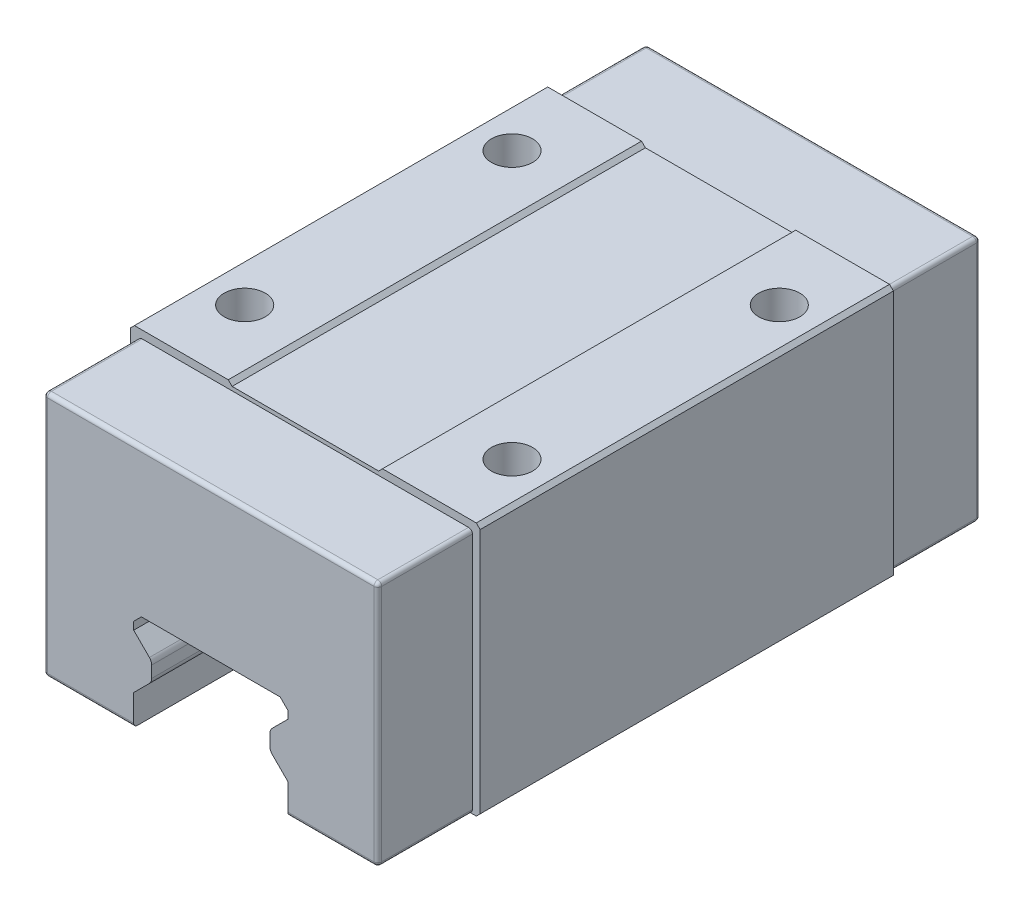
ISO-10303-21;
HEADER;
FILE_DESCRIPTION(('STEP AP214'),'2;1');
FILE_NAME('part.step','',(''),(''),'','','');
FILE_SCHEMA(('AUTOMOTIVE_DESIGN { 1 0 10303 214 1 1 1 1 }'));
ENDSEC;
DATA;
#1=APPLICATION_CONTEXT('core data for automotive mechanical design processes');
#2=APPLICATION_PROTOCOL_DEFINITION('international standard','automotive_design',2000,#1);
#3=PRODUCT_CONTEXT('',#1,'mechanical');
#4=PRODUCT('Part','Part','',(#3));
#5=PRODUCT_RELATED_PRODUCT_CATEGORY('part','',(#4));
#6=PRODUCT_DEFINITION_FORMATION('','',#4);
#7=PRODUCT_DEFINITION_CONTEXT('part definition',#1,'design');
#8=PRODUCT_DEFINITION('design','',#6,#7);
#9=PRODUCT_DEFINITION_SHAPE('','',#8);
#10=(LENGTH_UNIT() NAMED_UNIT(*) SI_UNIT(.MILLI.,.METRE.));
#11=(NAMED_UNIT(*) PLANE_ANGLE_UNIT() SI_UNIT($,.RADIAN.));
#12=(NAMED_UNIT(*) SI_UNIT($,.STERADIAN.) SOLID_ANGLE_UNIT());
#13=UNCERTAINTY_MEASURE_WITH_UNIT(LENGTH_MEASURE(1.E-05),#10,'distance_accuracy_value','');
#14=(GEOMETRIC_REPRESENTATION_CONTEXT(3) GLOBAL_UNCERTAINTY_ASSIGNED_CONTEXT((#13)) GLOBAL_UNIT_ASSIGNED_CONTEXT((#10,
#11,#12)) REPRESENTATION_CONTEXT('',''));
#15=CARTESIAN_POINT('',(0.,0.,0.));
#16=DIRECTION('',(0.,0.,1.));
#17=DIRECTION('',(1.,0.,0.));
#18=AXIS2_PLACEMENT_3D('',#15,#16,#17);
#19=CARTESIAN_POINT('',(-17.,28.,20.1));
#20=DIRECTION('',(0.,-1.,0.));
#21=DIRECTION('',(1.,0.,0.));
#22=AXIS2_PLACEMENT_3D('',#19,#20,#21);
#23=PLANE('',#22);
#24=CARTESIAN_POINT('',(-13.,28.,13.));
#25=DIRECTION('',(0.,1.,0.));
#26=DIRECTION('',(-1.,0.,0.));
#27=AXIS2_PLACEMENT_3D('',#24,#25,#26);
#28=CIRCLE('',#27,2.);
#29=CARTESIAN_POINT('',(-15.,28.,13.));
#30=VERTEX_POINT('',#29);
#31=EDGE_CURVE('E1099',#30,#30,#28,.T.);
#32=ORIENTED_EDGE('',*,*,#31,.F.);
#33=EDGE_LOOP('',(#32));
#34=FACE_BOUND('',#33,.T.);
#35=CARTESIAN_POINT('',(-13.,28.,-13.));
#36=DIRECTION('',(0.,1.,0.));
#37=DIRECTION('',(-1.,0.,0.));
#38=AXIS2_PLACEMENT_3D('',#35,#36,#37);
#39=CIRCLE('',#38,2.);
#40=CARTESIAN_POINT('',(-15.,28.,-13.));
#41=VERTEX_POINT('',#40);
#42=EDGE_CURVE('E1076',#41,#41,#39,.T.);
#43=ORIENTED_EDGE('',*,*,#42,.F.);
#44=EDGE_LOOP('',(#43));
#45=FACE_BOUND('',#44,.T.);
#46=DIRECTION('',(-1.,0.,0.));
#47=VECTOR('',#46,1.);
#48=CARTESIAN_POINT('',(-17.,28.,-20.1));
#49=LINE('',#48,#47);
#50=CARTESIAN_POINT('',(-7.5,28.,-20.1));
#51=VERTEX_POINT('',#50);
#52=CARTESIAN_POINT('',(-16.625,28.,-20.1));
#53=VERTEX_POINT('',#52);
#54=EDGE_CURVE('E790',#51,#53,#49,.T.);
#55=ORIENTED_EDGE('',*,*,#54,.T.);
#56=DIRECTION('',(0.,0.,1.));
#57=VECTOR('',#56,1.);
#58=CARTESIAN_POINT('',(-16.625,28.,20.1));
#59=LINE('',#58,#57);
#60=CARTESIAN_POINT('',(-16.625,28.,20.1));
#61=VERTEX_POINT('',#60);
#62=EDGE_CURVE('E391',#53,#61,#59,.T.);
#63=ORIENTED_EDGE('',*,*,#62,.T.);
#64=DIRECTION('',(-1.,0.,0.));
#65=VECTOR('',#64,1.);
#66=CARTESIAN_POINT('',(-17.,28.,20.1));
#67=LINE('',#66,#65);
#68=CARTESIAN_POINT('',(-7.5,28.,20.1));
#69=VERTEX_POINT('',#68);
#70=EDGE_CURVE('E374',#69,#61,#67,.T.);
#71=ORIENTED_EDGE('',*,*,#70,.F.);
#72=DIRECTION('',(0.,0.,-1.));
#73=VECTOR('',#72,1.);
#74=CARTESIAN_POINT('',(-7.5,28.,20.1));
#75=LINE('',#74,#73);
#76=EDGE_CURVE('E388',#69,#51,#75,.T.);
#77=ORIENTED_EDGE('',*,*,#76,.T.);
#78=EDGE_LOOP('',(#55,#63,#71,#77));
#79=FACE_BOUND('',#78,.T.);
#80=ADVANCED_FACE('F39',(#34,#45,#79),#23,.F.);
#81=CARTESIAN_POINT('',(7.5,13.,-29.3));
#82=DIRECTION('',(1.,0.,0.));
#83=DIRECTION('',(0.,1.,0.));
#84=AXIS2_PLACEMENT_3D('',#81,#82,#83);
#85=PLANE('',#84);
#86=DIRECTION('',(0.,-1.,0.));
#87=VECTOR('',#86,1.);
#88=CARTESIAN_POINT('',(7.5,0.,29.3));
#89=LINE('',#88,#87);
#90=CARTESIAN_POINT('',(7.5,12.25,29.3));
#91=VERTEX_POINT('',#90);
#92=CARTESIAN_POINT('',(7.5,11.5,29.3));
#93=VERTEX_POINT('',#92);
#94=EDGE_CURVE('E812',#91,#93,#89,.T.);
#95=ORIENTED_EDGE('',*,*,#94,.F.);
#96=DIRECTION('',(0.,0.,-1.));
#97=VECTOR('',#96,1.);
#98=CARTESIAN_POINT('',(7.5,12.25,-29.3));
#99=LINE('',#98,#97);
#100=CARTESIAN_POINT('',(7.5,12.25,-29.3));
#101=VERTEX_POINT('',#100);
#102=EDGE_CURVE('E822',#91,#101,#99,.T.);
#103=ORIENTED_EDGE('',*,*,#102,.T.);
#104=DIRECTION('',(0.,1.,0.));
#105=VECTOR('',#104,1.);
#106=CARTESIAN_POINT('',(7.5,13.,-29.3));
#107=LINE('',#106,#105);
#108=CARTESIAN_POINT('',(7.5,11.5,-29.3));
#109=VERTEX_POINT('',#108);
#110=EDGE_CURVE('E949',#109,#101,#107,.T.);
#111=ORIENTED_EDGE('',*,*,#110,.F.);
#112=DIRECTION('',(0.,0.,1.));
#113=VECTOR('',#112,1.);
#114=CARTESIAN_POINT('',(7.5,11.5,-34.8339859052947));
#115=LINE('',#114,#113);
#116=EDGE_CURVE('E1059',#109,#93,#115,.T.);
#117=ORIENTED_EDGE('',*,*,#116,.T.);
#118=EDGE_LOOP('',(#95,#103,#111,#117));
#119=FACE_BOUND('',#118,.T.);
#120=ADVANCED_FACE('F1118',(#119),#85,.F.);
#121=CARTESIAN_POINT('',(-7.5,13.,-29.3));
#122=DIRECTION('',(-1.,0.,0.));
#123=DIRECTION('',(0.,-1.,0.));
#124=AXIS2_PLACEMENT_3D('',#121,#122,#123);
#125=PLANE('',#124);
#126=DIRECTION('',(0.,-1.,0.));
#127=VECTOR('',#126,1.);
#128=CARTESIAN_POINT('',(-7.5,13.,29.3));
#129=LINE('',#128,#127);
#130=CARTESIAN_POINT('',(-7.5,6.25,29.3));
#131=VERTEX_POINT('',#130);
#132=CARTESIAN_POINT('',(-7.5,3.675,29.3));
#133=VERTEX_POINT('',#132);
#134=EDGE_CURVE('E958',#131,#133,#129,.T.);
#135=ORIENTED_EDGE('',*,*,#134,.T.);
#136=CARTESIAN_POINT('',(-7.5,3.675,28.925));
#137=DIRECTION('',(-1.,0.,0.));
#138=DIRECTION('',(0.,-1.,0.));
#139=AXIS2_PLACEMENT_3D('',#136,#137,#138);
#140=CIRCLE('',#139,0.375);
#141=CARTESIAN_POINT('',(-7.5,3.3,28.925));
#142=VERTEX_POINT('',#141);
#143=EDGE_CURVE('E561',#133,#142,#140,.F.);
#144=ORIENTED_EDGE('',*,*,#143,.T.);
#145=DIRECTION('',(0.,0.,1.));
#146=VECTOR('',#145,1.);
#147=CARTESIAN_POINT('',(-7.5,3.3,20.1));
#148=LINE('',#147,#146);
#149=CARTESIAN_POINT('',(-7.5,3.3,-28.925));
#150=VERTEX_POINT('',#149);
#151=EDGE_CURVE('E752',#150,#142,#148,.T.);
#152=ORIENTED_EDGE('',*,*,#151,.F.);
#153=CARTESIAN_POINT('',(-7.5,3.675,-28.925));
#154=DIRECTION('',(-1.,0.,0.));
#155=DIRECTION('',(0.,-1.,0.));
#156=AXIS2_PLACEMENT_3D('',#153,#154,#155);
#157=CIRCLE('',#156,0.375);
#158=CARTESIAN_POINT('',(-7.5,3.675,-29.3));
#159=VERTEX_POINT('',#158);
#160=EDGE_CURVE('E558',#150,#159,#157,.F.);
#161=ORIENTED_EDGE('',*,*,#160,.T.);
#162=DIRECTION('',(0.,-1.,0.));
#163=VECTOR('',#162,1.);
#164=CARTESIAN_POINT('',(-7.5,13.,-29.3));
#165=LINE('',#164,#163);
#166=CARTESIAN_POINT('',(-7.5,6.25,-29.3));
#167=VERTEX_POINT('',#166);
#168=EDGE_CURVE('E953',#167,#159,#165,.T.);
#169=ORIENTED_EDGE('',*,*,#168,.F.);
#170=DIRECTION('',(0.,0.,1.));
#171=VECTOR('',#170,1.);
#172=CARTESIAN_POINT('',(-7.5,6.25,-34.8339859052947));
#173=LINE('',#172,#171);
#174=EDGE_CURVE('E921',#167,#131,#173,.T.);
#175=ORIENTED_EDGE('',*,*,#174,.T.);
#176=EDGE_LOOP('',(#135,#144,#152,#161,#169,#175));
#177=FACE_BOUND('',#176,.T.);
#178=ADVANCED_FACE('F970',(#177),#125,.F.);
#179=CARTESIAN_POINT('',(-17.,3.3,20.1));
#180=DIRECTION('',(0.,1.,0.));
#181=DIRECTION('',(-1.,0.,0.));
#182=AXIS2_PLACEMENT_3D('',#179,#180,#181);
#183=PLANE('',#182);
#184=DIRECTION('',(0.,0.,-1.));
#185=VECTOR('',#184,1.);
#186=CARTESIAN_POINT('',(15.875,3.3,20.1));
#187=LINE('',#186,#185);
#188=CARTESIAN_POINT('',(15.875,3.3,20.1));
#189=VERTEX_POINT('',#188);
#190=CARTESIAN_POINT('',(15.875,3.3,28.925));
#191=VERTEX_POINT('',#190);
#192=EDGE_CURVE('E507',#189,#191,#187,.F.);
#193=ORIENTED_EDGE('',*,*,#192,.T.);
#194=DIRECTION('',(1.,0.,0.));
#195=VECTOR('',#194,1.);
#196=CARTESIAN_POINT('',(-17.,3.3,28.925));
#197=LINE('',#196,#195);
#198=CARTESIAN_POINT('',(7.5,3.3,28.925));
#199=VERTEX_POINT('',#198);
#200=EDGE_CURVE('E510',#191,#199,#197,.F.);
#201=ORIENTED_EDGE('',*,*,#200,.T.);
#202=DIRECTION('',(0.,0.,-1.));
#203=VECTOR('',#202,1.);
#204=CARTESIAN_POINT('',(7.5,3.3,20.1));
#205=LINE('',#204,#203);
#206=CARTESIAN_POINT('',(7.5,3.3,-28.925));
#207=VERTEX_POINT('',#206);
#208=EDGE_CURVE('E744',#199,#207,#205,.T.);
#209=ORIENTED_EDGE('',*,*,#208,.T.);
#210=DIRECTION('',(1.,0.,0.));
#211=VECTOR('',#210,1.);
#212=CARTESIAN_POINT('',(16.25,3.3,-28.925));
#213=LINE('',#212,#211);
#214=CARTESIAN_POINT('',(15.875,3.3,-28.925));
#215=VERTEX_POINT('',#214);
#216=EDGE_CURVE('E504',#207,#215,#213,.T.);
#217=ORIENTED_EDGE('',*,*,#216,.T.);
#218=DIRECTION('',(0.,0.,-1.));
#219=VECTOR('',#218,1.);
#220=CARTESIAN_POINT('',(15.875,3.3,20.1));
#221=LINE('',#220,#219);
#222=CARTESIAN_POINT('',(15.875,3.3,-20.1));
#223=VERTEX_POINT('',#222);
#224=EDGE_CURVE('E500',#215,#223,#221,.F.);
#225=ORIENTED_EDGE('',*,*,#224,.T.);
#226=DIRECTION('',(1.,0.,0.));
#227=VECTOR('',#226,1.);
#228=CARTESIAN_POINT('',(-17.,3.3,-20.1));
#229=LINE('',#228,#227);
#230=CARTESIAN_POINT('',(16.625,3.3,-20.1));
#231=VERTEX_POINT('',#230);
#232=EDGE_CURVE('E798',#223,#231,#229,.T.);
#233=ORIENTED_EDGE('',*,*,#232,.T.);
#234=DIRECTION('',(0.,0.,1.));
#235=VECTOR('',#234,1.);
#236=CARTESIAN_POINT('',(16.625,3.3,20.1));
#237=LINE('',#236,#235);
#238=CARTESIAN_POINT('',(16.625,3.3,20.1));
#239=VERTEX_POINT('',#238);
#240=EDGE_CURVE('E448',#231,#239,#237,.T.);
#241=ORIENTED_EDGE('',*,*,#240,.T.);
#242=DIRECTION('',(1.,0.,0.));
#243=VECTOR('',#242,1.);
#244=CARTESIAN_POINT('',(-17.,3.3,20.1));
#245=LINE('',#244,#243);
#246=EDGE_CURVE('E782',#189,#239,#245,.T.);
#247=ORIENTED_EDGE('',*,*,#246,.F.);
#248=EDGE_LOOP('',(#193,#201,#209,#217,#225,#233,#241,#247));
#249=FACE_BOUND('',#248,.T.);
#250=ADVANCED_FACE('F743',(#249),#183,.F.);
#251=CARTESIAN_POINT('',(0.,0.,20.1));
#252=DIRECTION('',(0.,0.,-1.));
#253=DIRECTION('',(-1.,0.,0.));
#254=AXIS2_PLACEMENT_3D('',#251,#252,#253);
#255=PLANE('',#254);
#256=DIRECTION('',(0.,1.,0.));
#257=VECTOR('',#256,1.);
#258=CARTESIAN_POINT('',(17.,3.3,20.1));
#259=LINE('',#258,#257);
#260=CARTESIAN_POINT('',(17.,3.67500000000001,20.1));
#261=VERTEX_POINT('',#260);
#262=CARTESIAN_POINT('',(17.,27.625,20.1));
#263=VERTEX_POINT('',#262);
#264=EDGE_CURVE('E394',#261,#263,#259,.T.);
#265=ORIENTED_EDGE('',*,*,#264,.T.);
#266=DIRECTION('',(0.707106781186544,-0.707106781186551,0.));
#267=VECTOR('',#266,1.);
#268=CARTESIAN_POINT('',(16.625,28.,20.1));
#269=LINE('',#268,#267);
#270=CARTESIAN_POINT('',(16.625,28.,20.1));
#271=VERTEX_POINT('',#270);
#272=EDGE_CURVE('E445',#263,#271,#269,.F.);
#273=ORIENTED_EDGE('',*,*,#272,.T.);
#274=CARTESIAN_POINT('',(7.5,28.,20.1));
#275=VERTEX_POINT('',#274);
#276=EDGE_CURVE('E393',#271,#275,#67,.T.);
#277=ORIENTED_EDGE('',*,*,#276,.T.);
#278=DIRECTION('',(0.707106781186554,0.707106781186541,0.));
#279=VECTOR('',#278,1.);
#280=CARTESIAN_POINT('',(-10.2500000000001,10.2500000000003,20.1));
#281=LINE('',#280,#279);
#282=CARTESIAN_POINT('',(7.12499999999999,27.625,20.1));
#283=VERTEX_POINT('',#282);
#284=EDGE_CURVE('E470',#275,#283,#281,.F.);
#285=ORIENTED_EDGE('',*,*,#284,.T.);
#286=DIRECTION('',(1.,0.,0.));
#287=VECTOR('',#286,1.);
#288=CARTESIAN_POINT('',(-7.5,27.625,20.1));
#289=LINE('',#288,#287);
#290=CARTESIAN_POINT('',(-7.125,27.625,20.1));
#291=VERTEX_POINT('',#290);
#292=EDGE_CURVE('E377',#291,#283,#289,.T.);
#293=ORIENTED_EDGE('',*,*,#292,.F.);
#294=DIRECTION('',(0.707106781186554,-0.707106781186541,0.));
#295=VECTOR('',#294,1.);
#296=CARTESIAN_POINT('',(10.2500000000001,10.2500000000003,20.1));
#297=LINE('',#296,#295);
#298=EDGE_CURVE('E370',#291,#69,#297,.F.);
#299=ORIENTED_EDGE('',*,*,#298,.T.);
#300=ORIENTED_EDGE('',*,*,#70,.T.);
#301=DIRECTION('',(0.707106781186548,0.707106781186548,0.));
#302=VECTOR('',#301,1.);
#303=CARTESIAN_POINT('',(-17.,27.625,20.1));
#304=LINE('',#303,#302);
#305=CARTESIAN_POINT('',(-17.,27.625,20.1));
#306=VERTEX_POINT('',#305);
#307=EDGE_CURVE('E436',#61,#306,#304,.F.);
#308=ORIENTED_EDGE('',*,*,#307,.T.);
#309=DIRECTION('',(0.,-1.,0.));
#310=VECTOR('',#309,1.);
#311=CARTESIAN_POINT('',(-17.,3.3,20.1));
#312=LINE('',#311,#310);
#313=CARTESIAN_POINT('',(-17.,3.675,20.1));
#314=VERTEX_POINT('',#313);
#315=EDGE_CURVE('E778',#306,#314,#312,.T.);
#316=ORIENTED_EDGE('',*,*,#315,.T.);
#317=DIRECTION('',(-0.707106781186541,0.707106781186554,0.));
#318=VECTOR('',#317,1.);
#319=CARTESIAN_POINT('',(-16.625,3.3,20.1));
#320=LINE('',#319,#318);
#321=CARTESIAN_POINT('',(-16.625,3.3,20.1));
#322=VERTEX_POINT('',#321);
#323=EDGE_CURVE('E439',#314,#322,#320,.F.);
#324=ORIENTED_EDGE('',*,*,#323,.T.);
#325=CARTESIAN_POINT('',(-15.875,3.3,20.1));
#326=VERTEX_POINT('',#325);
#327=EDGE_CURVE('E783',#322,#326,#245,.T.);
#328=ORIENTED_EDGE('',*,*,#327,.T.);
#329=CARTESIAN_POINT('',(-15.875,3.675,20.1));
#330=DIRECTION('',(0.,0.,-1.));
#331=DIRECTION('',(-1.,0.,0.));
#332=AXIS2_PLACEMENT_3D('',#329,#330,#331);
#333=CIRCLE('',#332,0.375);
#334=CARTESIAN_POINT('',(-16.25,3.675,20.1));
#335=VERTEX_POINT('',#334);
#336=EDGE_CURVE('E602',#326,#335,#333,.T.);
#337=ORIENTED_EDGE('',*,*,#336,.T.);
#338=DIRECTION('',(0.,-1.,0.));
#339=VECTOR('',#338,1.);
#340=CARTESIAN_POINT('',(-16.25,0.,20.1));
#341=LINE('',#340,#339);
#342=CARTESIAN_POINT('',(-16.25,26.875,20.1));
#343=VERTEX_POINT('',#342);
#344=EDGE_CURVE('E768',#343,#335,#341,.T.);
#345=ORIENTED_EDGE('',*,*,#344,.F.);
#346=CARTESIAN_POINT('',(-15.875,26.875,20.1));
#347=DIRECTION('',(0.,0.,-1.));
#348=DIRECTION('',(-1.,0.,0.));
#349=AXIS2_PLACEMENT_3D('',#346,#347,#348);
#350=CIRCLE('',#349,0.375);
#351=CARTESIAN_POINT('',(-15.875,27.25,20.1));
#352=VERTEX_POINT('',#351);
#353=EDGE_CURVE('E609',#343,#352,#350,.T.);
#354=ORIENTED_EDGE('',*,*,#353,.T.);
#355=DIRECTION('',(-1.,0.,0.));
#356=VECTOR('',#355,1.);
#357=CARTESIAN_POINT('',(0.,27.25,20.1));
#358=LINE('',#357,#356);
#359=CARTESIAN_POINT('',(15.875,27.25,20.1));
#360=VERTEX_POINT('',#359);
#361=EDGE_CURVE('E751',#360,#352,#358,.T.);
#362=ORIENTED_EDGE('',*,*,#361,.F.);
#363=CARTESIAN_POINT('',(15.875,26.875,20.1));
#364=DIRECTION('',(0.,0.,-1.));
#365=DIRECTION('',(-1.,0.,0.));
#366=AXIS2_PLACEMENT_3D('',#363,#364,#365);
#367=CIRCLE('',#366,0.375);
#368=CARTESIAN_POINT('',(16.25,26.875,20.1));
#369=VERTEX_POINT('',#368);
#370=EDGE_CURVE('E612',#360,#369,#367,.T.);
#371=ORIENTED_EDGE('',*,*,#370,.T.);
#372=DIRECTION('',(0.,1.,0.));
#373=VECTOR('',#372,1.);
#374=CARTESIAN_POINT('',(16.25,0.,20.1));
#375=LINE('',#374,#373);
#376=CARTESIAN_POINT('',(16.25,3.675,20.1));
#377=VERTEX_POINT('',#376);
#378=EDGE_CURVE('E757',#377,#369,#375,.T.);
#379=ORIENTED_EDGE('',*,*,#378,.F.);
#380=CARTESIAN_POINT('',(15.875,3.675,20.1));
#381=DIRECTION('',(0.,0.,-1.));
#382=DIRECTION('',(-1.,0.,0.));
#383=AXIS2_PLACEMENT_3D('',#380,#381,#382);
#384=CIRCLE('',#383,0.375);
#385=EDGE_CURVE('E605',#377,#189,#384,.T.);
#386=ORIENTED_EDGE('',*,*,#385,.T.);
#387=ORIENTED_EDGE('',*,*,#246,.T.);
#388=DIRECTION('',(-0.707106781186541,-0.707106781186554,0.));
#389=VECTOR('',#388,1.);
#390=CARTESIAN_POINT('',(17.,3.67500000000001,20.1));
#391=LINE('',#390,#389);
#392=EDGE_CURVE('E442',#239,#261,#391,.F.);
#393=ORIENTED_EDGE('',*,*,#392,.T.);
#394=EDGE_LOOP('',(#265,#273,#277,#285,#293,#299,#300,#308,#316,#324,#328,#337,#345,#354,#362,
#371,#379,#386,#387,#393));
#395=FACE_BOUND('',#394,.T.);
#396=ADVANCED_FACE('F373',(#395),#255,.F.);
#397=CARTESIAN_POINT('',(0.,0.,-20.1));
#398=DIRECTION('',(0.,0.,-1.));
#399=DIRECTION('',(-1.,0.,0.));
#400=AXIS2_PLACEMENT_3D('',#397,#398,#399);
#401=PLANE('',#400);
#402=CARTESIAN_POINT('',(16.625,28.,-20.1));
#403=VERTEX_POINT('',#402);
#404=CARTESIAN_POINT('',(7.5,28.,-20.1));
#405=VERTEX_POINT('',#404);
#406=EDGE_CURVE('E791',#403,#405,#49,.T.);
#407=ORIENTED_EDGE('',*,*,#406,.F.);
#408=DIRECTION('',(-0.707106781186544,0.707106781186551,0.));
#409=VECTOR('',#408,1.);
#410=CARTESIAN_POINT('',(22.3125000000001,22.3124999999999,-20.1));
#411=LINE('',#410,#409);
#412=CARTESIAN_POINT('',(17.,27.625,-20.1));
#413=VERTEX_POINT('',#412);
#414=EDGE_CURVE('E426',#403,#413,#411,.F.);
#415=ORIENTED_EDGE('',*,*,#414,.T.);
#416=DIRECTION('',(0.,1.,0.));
#417=VECTOR('',#416,1.);
#418=CARTESIAN_POINT('',(17.,3.3,-20.1));
#419=LINE('',#418,#417);
#420=CARTESIAN_POINT('',(17.,3.67500000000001,-20.1));
#421=VERTEX_POINT('',#420);
#422=EDGE_CURVE('E772',#421,#413,#419,.T.);
#423=ORIENTED_EDGE('',*,*,#422,.F.);
#424=DIRECTION('',(0.707106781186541,0.707106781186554,0.));
#425=VECTOR('',#424,1.);
#426=CARTESIAN_POINT('',(6.66250000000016,-6.66250000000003,-20.1));
#427=LINE('',#426,#425);
#428=EDGE_CURVE('E423',#421,#231,#427,.F.);
#429=ORIENTED_EDGE('',*,*,#428,.T.);
#430=ORIENTED_EDGE('',*,*,#232,.F.);
#431=CARTESIAN_POINT('',(15.875,3.675,-20.1));
#432=DIRECTION('',(0.,0.,-1.));
#433=DIRECTION('',(-1.,0.,0.));
#434=AXIS2_PLACEMENT_3D('',#431,#432,#433);
#435=CIRCLE('',#434,0.375);
#436=CARTESIAN_POINT('',(16.25,3.675,-20.1));
#437=VERTEX_POINT('',#436);
#438=EDGE_CURVE('E615',#223,#437,#435,.F.);
#439=ORIENTED_EDGE('',*,*,#438,.T.);
#440=DIRECTION('',(0.,1.,0.));
#441=VECTOR('',#440,1.);
#442=CARTESIAN_POINT('',(16.25,0.,-20.1));
#443=LINE('',#442,#441);
#444=CARTESIAN_POINT('',(16.25,26.875,-20.1));
#445=VERTEX_POINT('',#444);
#446=EDGE_CURVE('E804',#437,#445,#443,.T.);
#447=ORIENTED_EDGE('',*,*,#446,.T.);
#448=CARTESIAN_POINT('',(15.875,26.875,-20.1));
#449=DIRECTION('',(0.,0.,-1.));
#450=DIRECTION('',(-1.,0.,0.));
#451=AXIS2_PLACEMENT_3D('',#448,#449,#450);
#452=CIRCLE('',#451,0.375);
#453=CARTESIAN_POINT('',(15.875,27.25,-20.1));
#454=VERTEX_POINT('',#453);
#455=EDGE_CURVE('E49',#445,#454,#452,.F.);
#456=ORIENTED_EDGE('',*,*,#455,.T.);
#457=DIRECTION('',(-1.,0.,0.));
#458=VECTOR('',#457,1.);
#459=CARTESIAN_POINT('',(0.,27.25,-20.1));
#460=LINE('',#459,#458);
#461=CARTESIAN_POINT('',(-15.875,27.25,-20.1));
#462=VERTEX_POINT('',#461);
#463=EDGE_CURVE('E786',#454,#462,#460,.T.);
#464=ORIENTED_EDGE('',*,*,#463,.T.);
#465=CARTESIAN_POINT('',(-15.875,26.875,-20.1));
#466=DIRECTION('',(0.,0.,-1.));
#467=DIRECTION('',(-1.,0.,0.));
#468=AXIS2_PLACEMENT_3D('',#465,#466,#467);
#469=CIRCLE('',#468,0.375);
#470=CARTESIAN_POINT('',(-16.25,26.875,-20.1));
#471=VERTEX_POINT('',#470);
#472=EDGE_CURVE('E11',#462,#471,#469,.F.);
#473=ORIENTED_EDGE('',*,*,#472,.T.);
#474=DIRECTION('',(0.,-1.,0.));
#475=VECTOR('',#474,1.);
#476=CARTESIAN_POINT('',(-16.25,0.,-20.1));
#477=LINE('',#476,#475);
#478=CARTESIAN_POINT('',(-16.25,3.675,-20.1));
#479=VERTEX_POINT('',#478);
#480=EDGE_CURVE('E808',#471,#479,#477,.T.);
#481=ORIENTED_EDGE('',*,*,#480,.T.);
#482=CARTESIAN_POINT('',(-15.875,3.675,-20.1));
#483=DIRECTION('',(0.,0.,-1.));
#484=DIRECTION('',(-1.,0.,0.));
#485=AXIS2_PLACEMENT_3D('',#482,#483,#484);
#486=CIRCLE('',#485,0.375);
#487=CARTESIAN_POINT('',(-15.875,3.3,-20.1));
#488=VERTEX_POINT('',#487);
#489=EDGE_CURVE('E598',#479,#488,#486,.F.);
#490=ORIENTED_EDGE('',*,*,#489,.T.);
#491=CARTESIAN_POINT('',(-16.625,3.3,-20.1));
#492=VERTEX_POINT('',#491);
#493=EDGE_CURVE('E774',#492,#488,#229,.T.);
#494=ORIENTED_EDGE('',*,*,#493,.F.);
#495=DIRECTION('',(0.707106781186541,-0.707106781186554,0.));
#496=VECTOR('',#495,1.);
#497=CARTESIAN_POINT('',(-6.66250000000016,-6.66250000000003,-20.1));
#498=LINE('',#497,#496);
#499=CARTESIAN_POINT('',(-17.,3.675,-20.1));
#500=VERTEX_POINT('',#499);
#501=EDGE_CURVE('E420',#492,#500,#498,.F.);
#502=ORIENTED_EDGE('',*,*,#501,.T.);
#503=DIRECTION('',(0.,-1.,0.));
#504=VECTOR('',#503,1.);
#505=CARTESIAN_POINT('',(-17.,3.3,-20.1));
#506=LINE('',#505,#504);
#507=CARTESIAN_POINT('',(-17.,27.625,-20.1));
#508=VERTEX_POINT('',#507);
#509=EDGE_CURVE('E795',#508,#500,#506,.T.);
#510=ORIENTED_EDGE('',*,*,#509,.F.);
#511=DIRECTION('',(-0.707106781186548,-0.707106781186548,0.));
#512=VECTOR('',#511,1.);
#513=CARTESIAN_POINT('',(-22.3125,22.3125,-20.1));
#514=LINE('',#513,#512);
#515=EDGE_CURVE('E417',#508,#53,#514,.F.);
#516=ORIENTED_EDGE('',*,*,#515,.T.);
#517=ORIENTED_EDGE('',*,*,#54,.F.);
#518=DIRECTION('',(-0.707106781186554,0.707106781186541,0.));
#519=VECTOR('',#518,1.);
#520=CARTESIAN_POINT('',(-7.125,27.625,-20.1));
#521=LINE('',#520,#519);
#522=CARTESIAN_POINT('',(-7.125,27.625,-20.1));
#523=VERTEX_POINT('',#522);
#524=EDGE_CURVE('E383',#51,#523,#521,.F.);
#525=ORIENTED_EDGE('',*,*,#524,.T.);
#526=DIRECTION('',(-1.,0.,0.));
#527=VECTOR('',#526,1.);
#528=CARTESIAN_POINT('',(0.,27.625,-20.1));
#529=LINE('',#528,#527);
#530=CARTESIAN_POINT('',(7.12499999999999,27.625,-20.1));
#531=VERTEX_POINT('',#530);
#532=EDGE_CURVE('E399',#531,#523,#529,.T.);
#533=ORIENTED_EDGE('',*,*,#532,.F.);
#534=DIRECTION('',(-0.707106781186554,-0.707106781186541,0.));
#535=VECTOR('',#534,1.);
#536=CARTESIAN_POINT('',(7.5,28.,-20.1));
#537=LINE('',#536,#535);
#538=EDGE_CURVE('E384',#531,#405,#537,.F.);
#539=ORIENTED_EDGE('',*,*,#538,.T.);
#540=EDGE_LOOP('',(#407,#415,#423,#429,#430,#439,#447,#456,#464,#473,#481,#490,#494,#502,#510,
#516,#517,#525,#533,#539));
#541=FACE_BOUND('',#540,.T.);
#542=ADVANCED_FACE('F1026',(#541),#401,.T.);
#543=CARTESIAN_POINT('',(17.,3.3,20.1));
#544=DIRECTION('',(-1.,0.,0.));
#545=DIRECTION('',(0.,-1.,0.));
#546=AXIS2_PLACEMENT_3D('',#543,#544,#545);
#547=PLANE('',#546);
#548=ORIENTED_EDGE('',*,*,#422,.T.);
#549=DIRECTION('',(0.,0.,1.));
#550=VECTOR('',#549,1.);
#551=CARTESIAN_POINT('',(17.,27.625,20.1));
#552=LINE('',#551,#550);
#553=EDGE_CURVE('E433',#413,#263,#552,.T.);
#554=ORIENTED_EDGE('',*,*,#553,.T.);
#555=ORIENTED_EDGE('',*,*,#264,.F.);
#556=DIRECTION('',(0.,0.,-1.));
#557=VECTOR('',#556,1.);
#558=CARTESIAN_POINT('',(17.,3.67500000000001,20.1));
#559=LINE('',#558,#557);
#560=EDGE_CURVE('E429',#261,#421,#559,.T.);
#561=ORIENTED_EDGE('',*,*,#560,.T.);
#562=EDGE_LOOP('',(#548,#554,#555,#561));
#563=FACE_BOUND('',#562,.T.);
#564=ADVANCED_FACE('F1194',(#563),#547,.F.);
#565=CARTESIAN_POINT('',(13.,28.,-13.));
#566=DIRECTION('',(0.,1.,0.));
#567=DIRECTION('',(-1.,0.,0.));
#568=AXIS2_PLACEMENT_3D('',#565,#566,#567);
#569=CIRCLE('',#568,2.);
#570=CARTESIAN_POINT('',(11.,28.,-13.));
#571=VERTEX_POINT('',#570);
#572=EDGE_CURVE('E1084',#571,#571,#569,.T.);
#573=ORIENTED_EDGE('',*,*,#572,.F.);
#574=EDGE_LOOP('',(#573));
#575=FACE_BOUND('',#574,.T.);
#576=CARTESIAN_POINT('',(13.,28.,13.));
#577=DIRECTION('',(0.,1.,0.));
#578=DIRECTION('',(-1.,0.,0.));
#579=AXIS2_PLACEMENT_3D('',#576,#577,#578);
#580=CIRCLE('',#579,2.);
#581=CARTESIAN_POINT('',(11.,28.,13.));
#582=VERTEX_POINT('',#581);
#583=EDGE_CURVE('E1092',#582,#582,#580,.T.);
#584=ORIENTED_EDGE('',*,*,#583,.F.);
#585=EDGE_LOOP('',(#584));
#586=FACE_BOUND('',#585,.T.);
#587=ORIENTED_EDGE('',*,*,#276,.F.);
#588=DIRECTION('',(0.,0.,-1.));
#589=VECTOR('',#588,1.);
#590=CARTESIAN_POINT('',(16.625,28.,20.1));
#591=LINE('',#590,#589);
#592=EDGE_CURVE('E406',#271,#403,#591,.T.);
#593=ORIENTED_EDGE('',*,*,#592,.T.);
#594=ORIENTED_EDGE('',*,*,#406,.T.);
#595=DIRECTION('',(0.,0.,1.));
#596=VECTOR('',#595,1.);
#597=CARTESIAN_POINT('',(7.5,28.,20.1));
#598=LINE('',#597,#596);
#599=EDGE_CURVE('E400',#405,#275,#598,.T.);
#600=ORIENTED_EDGE('',*,*,#599,.T.);
#601=EDGE_LOOP('',(#587,#593,#594,#600));
#602=FACE_BOUND('',#601,.T.);
#603=ADVANCED_FACE('F1120',(#575,#586,#602),#23,.F.);
#604=CARTESIAN_POINT('',(-17.,3.3,20.1));
#605=DIRECTION('',(1.,0.,0.));
#606=DIRECTION('',(0.,1.,0.));
#607=AXIS2_PLACEMENT_3D('',#604,#605,#606);
#608=PLANE('',#607);
#609=ORIENTED_EDGE('',*,*,#509,.T.);
#610=DIRECTION('',(0.,0.,1.));
#611=VECTOR('',#610,1.);
#612=CARTESIAN_POINT('',(-17.,3.675,20.1));
#613=LINE('',#612,#611);
#614=EDGE_CURVE('E459',#500,#314,#613,.T.);
#615=ORIENTED_EDGE('',*,*,#614,.T.);
#616=ORIENTED_EDGE('',*,*,#315,.F.);
#617=DIRECTION('',(0.,0.,-1.));
#618=VECTOR('',#617,1.);
#619=CARTESIAN_POINT('',(-17.,27.625,20.1));
#620=LINE('',#619,#618);
#621=EDGE_CURVE('E455',#306,#508,#620,.T.);
#622=ORIENTED_EDGE('',*,*,#621,.T.);
#623=EDGE_LOOP('',(#609,#615,#616,#622));
#624=FACE_BOUND('',#623,.T.);
#625=ADVANCED_FACE('F1197',(#624),#608,.F.);
#626=DIRECTION('',(0.,0.,-1.));
#627=VECTOR('',#626,1.);
#628=CARTESIAN_POINT('',(-15.875,3.3,20.1));
#629=LINE('',#628,#627);
#630=CARTESIAN_POINT('',(-15.875,3.3,28.925));
#631=VERTEX_POINT('',#630);
#632=EDGE_CURVE('E487',#631,#326,#629,.T.);
#633=ORIENTED_EDGE('',*,*,#632,.T.);
#634=ORIENTED_EDGE('',*,*,#327,.F.);
#635=DIRECTION('',(0.,0.,-1.));
#636=VECTOR('',#635,1.);
#637=CARTESIAN_POINT('',(-16.625,3.3,20.1));
#638=LINE('',#637,#636);
#639=EDGE_CURVE('E451',#322,#492,#638,.T.);
#640=ORIENTED_EDGE('',*,*,#639,.T.);
#641=ORIENTED_EDGE('',*,*,#493,.T.);
#642=DIRECTION('',(0.,0.,-1.));
#643=VECTOR('',#642,1.);
#644=CARTESIAN_POINT('',(-15.875,3.3,20.1));
#645=LINE('',#644,#643);
#646=CARTESIAN_POINT('',(-15.875,3.3,-28.925));
#647=VERTEX_POINT('',#646);
#648=EDGE_CURVE('E480',#488,#647,#645,.T.);
#649=ORIENTED_EDGE('',*,*,#648,.T.);
#650=DIRECTION('',(1.,0.,0.));
#651=VECTOR('',#650,1.);
#652=CARTESIAN_POINT('',(-7.5,3.3,-28.925));
#653=LINE('',#652,#651);
#654=EDGE_CURVE('E477',#647,#150,#653,.T.);
#655=ORIENTED_EDGE('',*,*,#654,.T.);
#656=ORIENTED_EDGE('',*,*,#151,.T.);
#657=DIRECTION('',(1.,0.,0.));
#658=VECTOR('',#657,1.);
#659=CARTESIAN_POINT('',(-17.,3.3,28.925));
#660=LINE('',#659,#658);
#661=EDGE_CURVE('E484',#142,#631,#660,.F.);
#662=ORIENTED_EDGE('',*,*,#661,.T.);
#663=EDGE_LOOP('',(#633,#634,#640,#641,#649,#655,#656,#662));
#664=FACE_BOUND('',#663,.T.);
#665=ADVANCED_FACE('F982',(#664),#183,.F.);
#666=CARTESIAN_POINT('',(0.,0.,-29.3));
#667=DIRECTION('',(0.,0.,-1.));
#668=DIRECTION('',(-1.,0.,0.));
#669=AXIS2_PLACEMENT_3D('',#666,#667,#668);
#670=PLANE('',#669);
#671=DIRECTION('',(0.,1.,0.));
#672=VECTOR('',#671,1.);
#673=CARTESIAN_POINT('',(15.875,3.3,-29.3));
#674=LINE('',#673,#672);
#675=CARTESIAN_POINT('',(15.875,26.875,-29.3));
#676=VERTEX_POINT('',#675);
#677=CARTESIAN_POINT('',(15.875,3.675,-29.3));
#678=VERTEX_POINT('',#677);
#679=EDGE_CURVE('E522',#676,#678,#674,.F.);
#680=ORIENTED_EDGE('',*,*,#679,.T.);
#681=DIRECTION('',(1.,0.,0.));
#682=VECTOR('',#681,1.);
#683=CARTESIAN_POINT('',(7.5,3.675,-29.3));
#684=LINE('',#683,#682);
#685=CARTESIAN_POINT('',(7.5,3.675,-29.3));
#686=VERTEX_POINT('',#685);
#687=EDGE_CURVE('E525',#678,#686,#684,.F.);
#688=ORIENTED_EDGE('',*,*,#687,.T.);
#689=CARTESIAN_POINT('',(7.5,6.25000000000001,-29.3));
#690=VERTEX_POINT('',#689);
#691=EDGE_CURVE('E945',#686,#690,#107,.T.);
#692=ORIENTED_EDGE('',*,*,#691,.T.);
#693=DIRECTION('',(0.70710678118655,-0.707106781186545,0.));
#694=VECTOR('',#693,1.);
#695=CARTESIAN_POINT('',(7.5,6.25,-29.3));
#696=LINE('',#695,#694);
#697=CARTESIAN_POINT('',(5.96966991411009,7.78033008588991,-29.3));
#698=VERTEX_POINT('',#697);
#699=EDGE_CURVE('E1045',#698,#690,#696,.T.);
#700=ORIENTED_EDGE('',*,*,#699,.F.);
#701=CARTESIAN_POINT('',(6.49999999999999,8.31066017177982,-29.3));
#702=DIRECTION('',(0.,0.,-1.));
#703=DIRECTION('',(-1.,0.,0.));
#704=AXIS2_PLACEMENT_3D('',#701,#702,#703);
#705=CIRCLE('',#704,0.75);
#706=CARTESIAN_POINT('',(5.74999999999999,8.31066017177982,-29.3));
#707=VERTEX_POINT('',#706);
#708=EDGE_CURVE('E871',#698,#707,#705,.T.);
#709=ORIENTED_EDGE('',*,*,#708,.T.);
#710=DIRECTION('',(0.,-1.,0.));
#711=VECTOR('',#710,1.);
#712=CARTESIAN_POINT('',(5.74999999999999,8.,-29.3));
#713=LINE('',#712,#711);
#714=CARTESIAN_POINT('',(5.75,9.43933982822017,-29.3));
#715=VERTEX_POINT('',#714);
#716=EDGE_CURVE('E1047',#715,#707,#713,.T.);
#717=ORIENTED_EDGE('',*,*,#716,.F.);
#718=CARTESIAN_POINT('',(6.5,9.43933982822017,-29.3));
#719=DIRECTION('',(0.,0.,-1.));
#720=DIRECTION('',(-1.,0.,0.));
#721=AXIS2_PLACEMENT_3D('',#718,#719,#720);
#722=CIRCLE('',#721,0.75);
#723=CARTESIAN_POINT('',(5.96966991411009,9.96966991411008,-29.3));
#724=VERTEX_POINT('',#723);
#725=EDGE_CURVE('E868',#715,#724,#722,.T.);
#726=ORIENTED_EDGE('',*,*,#725,.T.);
#727=DIRECTION('',(-0.707106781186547,-0.707106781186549,0.));
#728=VECTOR('',#727,1.);
#729=CARTESIAN_POINT('',(5.75,9.74999999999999,-29.3));
#730=LINE('',#729,#728);
#731=EDGE_CURVE('E1051',#109,#724,#730,.T.);
#732=ORIENTED_EDGE('',*,*,#731,.F.);
#733=ORIENTED_EDGE('',*,*,#110,.T.);
#734=DIRECTION('',(0.707106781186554,-0.707106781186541,0.));
#735=VECTOR('',#734,1.);
#736=CARTESIAN_POINT('',(6.74999999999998,13.,-29.3));
#737=LINE('',#736,#735);
#738=CARTESIAN_POINT('',(6.74999999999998,13.,-29.3));
#739=VERTEX_POINT('',#738);
#740=EDGE_CURVE('E831',#101,#739,#737,.F.);
#741=ORIENTED_EDGE('',*,*,#740,.T.);
#742=DIRECTION('',(-1.,0.,0.));
#743=VECTOR('',#742,1.);
#744=CARTESIAN_POINT('',(-7.5,13.,-29.3));
#745=LINE('',#744,#743);
#746=CARTESIAN_POINT('',(-6.75000000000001,13.,-29.3));
#747=VERTEX_POINT('',#746);
#748=EDGE_CURVE('E948',#739,#747,#745,.T.);
#749=ORIENTED_EDGE('',*,*,#748,.T.);
#750=DIRECTION('',(0.707106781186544,0.707106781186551,0.));
#751=VECTOR('',#750,1.);
#752=CARTESIAN_POINT('',(-7.5,12.25,-29.3));
#753=LINE('',#752,#751);
#754=CARTESIAN_POINT('',(-7.5,12.25,-29.3));
#755=VERTEX_POINT('',#754);
#756=EDGE_CURVE('E837',#747,#755,#753,.F.);
#757=ORIENTED_EDGE('',*,*,#756,.T.);
#758=CARTESIAN_POINT('',(-7.5,11.5,-29.3));
#759=VERTEX_POINT('',#758);
#760=EDGE_CURVE('E761',#755,#759,#165,.T.);
#761=ORIENTED_EDGE('',*,*,#760,.T.);
#762=DIRECTION('',(-0.707106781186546,0.707106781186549,0.));
#763=VECTOR('',#762,1.);
#764=CARTESIAN_POINT('',(-5.75,9.74999999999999,-29.3));
#765=LINE('',#764,#763);
#766=CARTESIAN_POINT('',(-5.96966991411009,9.96966991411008,-29.3));
#767=VERTEX_POINT('',#766);
#768=EDGE_CURVE('E896',#767,#759,#765,.T.);
#769=ORIENTED_EDGE('',*,*,#768,.F.);
#770=CARTESIAN_POINT('',(-6.5,9.43933982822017,-29.3));
#771=DIRECTION('',(0.,0.,-1.));
#772=DIRECTION('',(-1.,0.,0.));
#773=AXIS2_PLACEMENT_3D('',#770,#771,#772);
#774=CIRCLE('',#773,0.75);
#775=CARTESIAN_POINT('',(-5.75,9.43933982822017,-29.3));
#776=VERTEX_POINT('',#775);
#777=EDGE_CURVE('E862',#767,#776,#774,.T.);
#778=ORIENTED_EDGE('',*,*,#777,.T.);
#779=DIRECTION('',(0.,1.,0.));
#780=VECTOR('',#779,1.);
#781=CARTESIAN_POINT('',(-5.74999999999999,8.,-29.3));
#782=LINE('',#781,#780);
#783=CARTESIAN_POINT('',(-5.74999999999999,8.31066017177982,-29.3));
#784=VERTEX_POINT('',#783);
#785=EDGE_CURVE('E909',#784,#776,#782,.T.);
#786=ORIENTED_EDGE('',*,*,#785,.F.);
#787=CARTESIAN_POINT('',(-6.49999999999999,8.31066017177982,-29.3));
#788=DIRECTION('',(0.,0.,-1.));
#789=DIRECTION('',(-1.,0.,0.));
#790=AXIS2_PLACEMENT_3D('',#787,#788,#789);
#791=CIRCLE('',#790,0.75);
#792=CARTESIAN_POINT('',(-5.96966991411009,7.78033008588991,-29.3));
#793=VERTEX_POINT('',#792);
#794=EDGE_CURVE('E865',#784,#793,#791,.T.);
#795=ORIENTED_EDGE('',*,*,#794,.T.);
#796=DIRECTION('',(0.70710678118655,0.707106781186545,0.));
#797=VECTOR('',#796,1.);
#798=CARTESIAN_POINT('',(-7.5,6.25,-29.3));
#799=LINE('',#798,#797);
#800=EDGE_CURVE('E927',#167,#793,#799,.T.);
#801=ORIENTED_EDGE('',*,*,#800,.F.);
#802=ORIENTED_EDGE('',*,*,#168,.T.);
#803=DIRECTION('',(1.,0.,0.));
#804=VECTOR('',#803,1.);
#805=CARTESIAN_POINT('',(-16.25,3.675,-29.3));
#806=LINE('',#805,#804);
#807=CARTESIAN_POINT('',(-15.875,3.675,-29.3));
#808=VERTEX_POINT('',#807);
#809=EDGE_CURVE('E519',#159,#808,#806,.F.);
#810=ORIENTED_EDGE('',*,*,#809,.T.);
#811=DIRECTION('',(0.,-1.,0.));
#812=VECTOR('',#811,1.);
#813=CARTESIAN_POINT('',(-15.875,27.25,-29.3));
#814=LINE('',#813,#812);
#815=CARTESIAN_POINT('',(-15.875,26.875,-29.3));
#816=VERTEX_POINT('',#815);
#817=EDGE_CURVE('E516',#808,#816,#814,.F.);
#818=ORIENTED_EDGE('',*,*,#817,.T.);
#819=DIRECTION('',(-1.,0.,0.));
#820=VECTOR('',#819,1.);
#821=CARTESIAN_POINT('',(16.25,26.875,-29.3));
#822=LINE('',#821,#820);
#823=EDGE_CURVE('E513',#816,#676,#822,.F.);
#824=ORIENTED_EDGE('',*,*,#823,.T.);
#825=EDGE_LOOP('',(#680,#688,#692,#700,#709,#717,#726,#732,#733,#741,#749,#757,#761,#769,#778,
#786,#795,#801,#802,#810,#818,#824));
#826=FACE_BOUND('',#825,.T.);
#827=ADVANCED_FACE('F902',(#826),#670,.T.);
#828=CARTESIAN_POINT('',(-16.25,27.25,29.3));
#829=DIRECTION('',(0.,-1.,0.));
#830=DIRECTION('',(1.,0.,0.));
#831=AXIS2_PLACEMENT_3D('',#828,#829,#830);
#832=PLANE('',#831);
#833=ORIENTED_EDGE('',*,*,#463,.F.);
#834=DIRECTION('',(0.,0.,-1.));
#835=VECTOR('',#834,1.);
#836=CARTESIAN_POINT('',(15.875,27.25,29.3));
#837=LINE('',#836,#835);
#838=CARTESIAN_POINT('',(15.875,27.25,-28.925));
#839=VERTEX_POINT('',#838);
#840=EDGE_CURVE('E62',#454,#839,#837,.T.);
#841=ORIENTED_EDGE('',*,*,#840,.T.);
#842=DIRECTION('',(-1.,0.,0.));
#843=VECTOR('',#842,1.);
#844=CARTESIAN_POINT('',(-16.25,27.25,-28.925));
#845=LINE('',#844,#843);
#846=CARTESIAN_POINT('',(-15.875,27.25,-28.925));
#847=VERTEX_POINT('',#846);
#848=EDGE_CURVE('E57',#839,#847,#845,.T.);
#849=ORIENTED_EDGE('',*,*,#848,.T.);
#850=DIRECTION('',(0.,0.,-1.));
#851=VECTOR('',#850,1.);
#852=CARTESIAN_POINT('',(-15.875,27.25,29.3));
#853=LINE('',#852,#851);
#854=EDGE_CURVE('E593',#847,#462,#853,.F.);
#855=ORIENTED_EDGE('',*,*,#854,.T.);
#856=EDGE_LOOP('',(#833,#841,#849,#855));
#857=FACE_BOUND('',#856,.T.);
#858=ADVANCED_FACE('F1179',(#857),#832,.F.);
#859=CARTESIAN_POINT('',(16.25,3.3,29.3));
#860=DIRECTION('',(-1.,0.,0.));
#861=DIRECTION('',(0.,-1.,0.));
#862=AXIS2_PLACEMENT_3D('',#859,#860,#861);
#863=PLANE('',#862);
#864=ORIENTED_EDGE('',*,*,#446,.F.);
#865=DIRECTION('',(0.,0.,-1.));
#866=VECTOR('',#865,1.);
#867=CARTESIAN_POINT('',(16.25,3.675,29.3));
#868=LINE('',#867,#866);
#869=CARTESIAN_POINT('',(16.25,3.675,-28.925));
#870=VERTEX_POINT('',#869);
#871=EDGE_CURVE('E588',#437,#870,#868,.T.);
#872=ORIENTED_EDGE('',*,*,#871,.T.);
#873=DIRECTION('',(0.,1.,0.));
#874=VECTOR('',#873,1.);
#875=CARTESIAN_POINT('',(16.25,27.25,-28.925));
#876=LINE('',#875,#874);
#877=CARTESIAN_POINT('',(16.25,26.875,-28.925));
#878=VERTEX_POINT('',#877);
#879=EDGE_CURVE('E585',#870,#878,#876,.T.);
#880=ORIENTED_EDGE('',*,*,#879,.T.);
#881=DIRECTION('',(0.,0.,-1.));
#882=VECTOR('',#881,1.);
#883=CARTESIAN_POINT('',(16.25,26.875,29.3));
#884=LINE('',#883,#882);
#885=EDGE_CURVE('E582',#878,#445,#884,.F.);
#886=ORIENTED_EDGE('',*,*,#885,.T.);
#887=EDGE_LOOP('',(#864,#872,#880,#886));
#888=FACE_BOUND('',#887,.T.);
#889=ADVANCED_FACE('F1022',(#888),#863,.F.);
#890=CARTESIAN_POINT('',(-16.25,3.3,29.3));
#891=DIRECTION('',(1.,0.,0.));
#892=DIRECTION('',(0.,1.,0.));
#893=AXIS2_PLACEMENT_3D('',#890,#891,#892);
#894=PLANE('',#893);
#895=DIRECTION('',(0.,-1.,0.));
#896=VECTOR('',#895,1.);
#897=CARTESIAN_POINT('',(-16.25,3.3,-28.925));
#898=LINE('',#897,#896);
#899=CARTESIAN_POINT('',(-16.25,26.875,-28.925));
#900=VERTEX_POINT('',#899);
#901=CARTESIAN_POINT('',(-16.25,3.675,-28.925));
#902=VERTEX_POINT('',#901);
#903=EDGE_CURVE('E491',#900,#902,#898,.T.);
#904=ORIENTED_EDGE('',*,*,#903,.T.);
#905=DIRECTION('',(0.,0.,-1.));
#906=VECTOR('',#905,1.);
#907=CARTESIAN_POINT('',(-16.25,3.675,29.3));
#908=LINE('',#907,#906);
#909=EDGE_CURVE('E497',#902,#479,#908,.F.);
#910=ORIENTED_EDGE('',*,*,#909,.T.);
#911=ORIENTED_EDGE('',*,*,#480,.F.);
#912=DIRECTION('',(0.,0.,-1.));
#913=VECTOR('',#912,1.);
#914=CARTESIAN_POINT('',(-16.25,26.875,29.3));
#915=LINE('',#914,#913);
#916=EDGE_CURVE('E494',#471,#900,#915,.T.);
#917=ORIENTED_EDGE('',*,*,#916,.T.);
#918=EDGE_LOOP('',(#904,#910,#911,#917));
#919=FACE_BOUND('',#918,.T.);
#920=ADVANCED_FACE('F1184',(#919),#894,.F.);
#921=ORIENTED_EDGE('',*,*,#344,.T.);
#922=DIRECTION('',(0.,0.,-1.));
#923=VECTOR('',#922,1.);
#924=CARTESIAN_POINT('',(-16.25,3.675,29.3));
#925=LINE('',#924,#923);
#926=CARTESIAN_POINT('',(-16.25,3.675,28.925));
#927=VERTEX_POINT('',#926);
#928=EDGE_CURVE('E540',#335,#927,#925,.F.);
#929=ORIENTED_EDGE('',*,*,#928,.T.);
#930=DIRECTION('',(0.,-1.,0.));
#931=VECTOR('',#930,1.);
#932=CARTESIAN_POINT('',(-16.25,3.3,28.925));
#933=LINE('',#932,#931);
#934=CARTESIAN_POINT('',(-16.25,26.875,28.925));
#935=VERTEX_POINT('',#934);
#936=EDGE_CURVE('E537',#927,#935,#933,.F.);
#937=ORIENTED_EDGE('',*,*,#936,.T.);
#938=DIRECTION('',(0.,0.,-1.));
#939=VECTOR('',#938,1.);
#940=CARTESIAN_POINT('',(-16.25,26.875,29.3));
#941=LINE('',#940,#939);
#942=EDGE_CURVE('E534',#935,#343,#941,.T.);
#943=ORIENTED_EDGE('',*,*,#942,.T.);
#944=EDGE_LOOP('',(#921,#929,#937,#943));
#945=FACE_BOUND('',#944,.T.);
#946=ADVANCED_FACE('F1188',(#945),#894,.F.);
#947=DIRECTION('',(0.,1.,0.));
#948=VECTOR('',#947,1.);
#949=CARTESIAN_POINT('',(16.25,3.3,28.925));
#950=LINE('',#949,#948);
#951=CARTESIAN_POINT('',(16.25,26.875,28.925));
#952=VERTEX_POINT('',#951);
#953=CARTESIAN_POINT('',(16.25,3.675,28.925));
#954=VERTEX_POINT('',#953);
#955=EDGE_CURVE('E564',#952,#954,#950,.F.);
#956=ORIENTED_EDGE('',*,*,#955,.T.);
#957=DIRECTION('',(0.,0.,-1.));
#958=VECTOR('',#957,1.);
#959=CARTESIAN_POINT('',(16.25,3.675,29.3));
#960=LINE('',#959,#958);
#961=EDGE_CURVE('E570',#954,#377,#960,.T.);
#962=ORIENTED_EDGE('',*,*,#961,.T.);
#963=ORIENTED_EDGE('',*,*,#378,.T.);
#964=DIRECTION('',(0.,0.,-1.));
#965=VECTOR('',#964,1.);
#966=CARTESIAN_POINT('',(16.25,26.875,29.3));
#967=LINE('',#966,#965);
#968=EDGE_CURVE('E567',#369,#952,#967,.F.);
#969=ORIENTED_EDGE('',*,*,#968,.T.);
#970=EDGE_LOOP('',(#956,#962,#963,#969));
#971=FACE_BOUND('',#970,.T.);
#972=ADVANCED_FACE('F1185',(#971),#863,.F.);
#973=ORIENTED_EDGE('',*,*,#361,.T.);
#974=DIRECTION('',(0.,0.,-1.));
#975=VECTOR('',#974,1.);
#976=CARTESIAN_POINT('',(-15.875,27.25,29.3));
#977=LINE('',#976,#975);
#978=CARTESIAN_POINT('',(-15.875,27.25,28.925));
#979=VERTEX_POINT('',#978);
#980=EDGE_CURVE('E579',#352,#979,#977,.F.);
#981=ORIENTED_EDGE('',*,*,#980,.T.);
#982=DIRECTION('',(-1.,0.,0.));
#983=VECTOR('',#982,1.);
#984=CARTESIAN_POINT('',(-16.25,27.25,28.925));
#985=LINE('',#984,#983);
#986=CARTESIAN_POINT('',(15.875,27.25,28.925));
#987=VERTEX_POINT('',#986);
#988=EDGE_CURVE('E573',#979,#987,#985,.F.);
#989=ORIENTED_EDGE('',*,*,#988,.T.);
#990=DIRECTION('',(0.,0.,-1.));
#991=VECTOR('',#990,1.);
#992=CARTESIAN_POINT('',(15.875,27.25,29.3));
#993=LINE('',#992,#991);
#994=EDGE_CURVE('E576',#987,#360,#993,.T.);
#995=ORIENTED_EDGE('',*,*,#994,.T.);
#996=EDGE_LOOP('',(#973,#981,#989,#995));
#997=FACE_BOUND('',#996,.T.);
#998=ADVANCED_FACE('F1176',(#997),#832,.F.);
#999=CARTESIAN_POINT('',(0.,0.,29.3));
#1000=DIRECTION('',(0.,0.,-1.));
#1001=DIRECTION('',(-1.,0.,0.));
#1002=AXIS2_PLACEMENT_3D('',#999,#1000,#1001);
#1003=PLANE('',#1002);
#1004=DIRECTION('',(0.,-1.,0.));
#1005=VECTOR('',#1004,1.);
#1006=CARTESIAN_POINT('',(-15.875,0.,29.3));
#1007=LINE('',#1006,#1005);
#1008=CARTESIAN_POINT('',(-15.875,26.875,29.3));
#1009=VERTEX_POINT('',#1008);
#1010=CARTESIAN_POINT('',(-15.875,3.675,29.3));
#1011=VERTEX_POINT('',#1010);
#1012=EDGE_CURVE('E549',#1009,#1011,#1007,.T.);
#1013=ORIENTED_EDGE('',*,*,#1012,.T.);
#1014=DIRECTION('',(1.,0.,0.));
#1015=VECTOR('',#1014,1.);
#1016=CARTESIAN_POINT('',(0.,3.675,29.3));
#1017=LINE('',#1016,#1015);
#1018=EDGE_CURVE('E555',#1011,#133,#1017,.T.);
#1019=ORIENTED_EDGE('',*,*,#1018,.T.);
#1020=ORIENTED_EDGE('',*,*,#134,.F.);
#1021=DIRECTION('',(0.70710678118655,0.707106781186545,0.));
#1022=VECTOR('',#1021,1.);
#1023=CARTESIAN_POINT('',(-7.5,6.25,29.3));
#1024=LINE('',#1023,#1022);
#1025=CARTESIAN_POINT('',(-5.96966991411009,7.78033008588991,29.3));
#1026=VERTEX_POINT('',#1025);
#1027=EDGE_CURVE('E922',#131,#1026,#1024,.T.);
#1028=ORIENTED_EDGE('',*,*,#1027,.T.);
#1029=CARTESIAN_POINT('',(-6.49999999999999,8.31066017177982,29.3));
#1030=DIRECTION('',(0.,0.,-1.));
#1031=DIRECTION('',(-1.,0.,0.));
#1032=AXIS2_PLACEMENT_3D('',#1029,#1030,#1031);
#1033=CIRCLE('',#1032,0.75);
#1034=CARTESIAN_POINT('',(-5.74999999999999,8.31066017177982,29.3));
#1035=VERTEX_POINT('',#1034);
#1036=EDGE_CURVE('E850',#1026,#1035,#1033,.F.);
#1037=ORIENTED_EDGE('',*,*,#1036,.T.);
#1038=DIRECTION('',(0.,1.,0.));
#1039=VECTOR('',#1038,1.);
#1040=CARTESIAN_POINT('',(-5.74999999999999,8.,29.3));
#1041=LINE('',#1040,#1039);
#1042=CARTESIAN_POINT('',(-5.75,9.43933982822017,29.3));
#1043=VERTEX_POINT('',#1042);
#1044=EDGE_CURVE('E917',#1035,#1043,#1041,.T.);
#1045=ORIENTED_EDGE('',*,*,#1044,.T.);
#1046=CARTESIAN_POINT('',(-6.5,9.43933982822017,29.3));
#1047=DIRECTION('',(0.,0.,-1.));
#1048=DIRECTION('',(-1.,0.,0.));
#1049=AXIS2_PLACEMENT_3D('',#1046,#1047,#1048);
#1050=CIRCLE('',#1049,0.75);
#1051=CARTESIAN_POINT('',(-5.96966991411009,9.96966991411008,29.3));
#1052=VERTEX_POINT('',#1051);
#1053=EDGE_CURVE('E847',#1043,#1052,#1050,.F.);
#1054=ORIENTED_EDGE('',*,*,#1053,.T.);
#1055=DIRECTION('',(-0.707106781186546,0.707106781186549,0.));
#1056=VECTOR('',#1055,1.);
#1057=CARTESIAN_POINT('',(-5.75,9.74999999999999,29.3));
#1058=LINE('',#1057,#1056);
#1059=CARTESIAN_POINT('',(-7.5,11.5,29.3));
#1060=VERTEX_POINT('',#1059);
#1061=EDGE_CURVE('E898',#1052,#1060,#1058,.T.);
#1062=ORIENTED_EDGE('',*,*,#1061,.T.);
#1063=CARTESIAN_POINT('',(-7.5,12.25,29.3));
#1064=VERTEX_POINT('',#1063);
#1065=EDGE_CURVE('E959',#1064,#1060,#129,.T.);
#1066=ORIENTED_EDGE('',*,*,#1065,.F.);
#1067=DIRECTION('',(-0.707106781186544,-0.707106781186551,0.));
#1068=VECTOR('',#1067,1.);
#1069=CARTESIAN_POINT('',(-9.87500000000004,9.87499999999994,29.3));
#1070=LINE('',#1069,#1068);
#1071=CARTESIAN_POINT('',(-6.75000000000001,13.,29.3));
#1072=VERTEX_POINT('',#1071);
#1073=EDGE_CURVE('E834',#1064,#1072,#1070,.F.);
#1074=ORIENTED_EDGE('',*,*,#1073,.T.);
#1075=DIRECTION('',(-1.,0.,0.));
#1076=VECTOR('',#1075,1.);
#1077=CARTESIAN_POINT('',(-7.5,13.,29.3));
#1078=LINE('',#1077,#1076);
#1079=CARTESIAN_POINT('',(6.74999999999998,13.,29.3));
#1080=VERTEX_POINT('',#1079);
#1081=EDGE_CURVE('E944',#1080,#1072,#1078,.T.);
#1082=ORIENTED_EDGE('',*,*,#1081,.F.);
#1083=DIRECTION('',(-0.707106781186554,0.707106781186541,0.));
#1084=VECTOR('',#1083,1.);
#1085=CARTESIAN_POINT('',(9.87499999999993,9.87500000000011,29.3));
#1086=LINE('',#1085,#1084);
#1087=EDGE_CURVE('E828',#1080,#91,#1086,.F.);
#1088=ORIENTED_EDGE('',*,*,#1087,.T.);
#1089=ORIENTED_EDGE('',*,*,#94,.T.);
#1090=DIRECTION('',(-0.707106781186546,-0.707106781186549,0.));
#1091=VECTOR('',#1090,1.);
#1092=CARTESIAN_POINT('',(5.75,9.74999999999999,29.3));
#1093=LINE('',#1092,#1091);
#1094=CARTESIAN_POINT('',(5.96966991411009,9.96966991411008,29.3));
#1095=VERTEX_POINT('',#1094);
#1096=EDGE_CURVE('E1069',#93,#1095,#1093,.T.);
#1097=ORIENTED_EDGE('',*,*,#1096,.T.);
#1098=CARTESIAN_POINT('',(6.5,9.43933982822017,29.3));
#1099=DIRECTION('',(0.,0.,-1.));
#1100=DIRECTION('',(-1.,0.,0.));
#1101=AXIS2_PLACEMENT_3D('',#1098,#1099,#1100);
#1102=CIRCLE('',#1101,0.75);
#1103=CARTESIAN_POINT('',(5.75,9.43933982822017,29.3));
#1104=VERTEX_POINT('',#1103);
#1105=EDGE_CURVE('E853',#1095,#1104,#1102,.F.);
#1106=ORIENTED_EDGE('',*,*,#1105,.T.);
#1107=DIRECTION('',(0.,-1.,0.));
#1108=VECTOR('',#1107,1.);
#1109=CARTESIAN_POINT('',(5.74999999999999,8.,29.3));
#1110=LINE('',#1109,#1108);
#1111=CARTESIAN_POINT('',(5.74999999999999,8.31066017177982,29.3));
#1112=VERTEX_POINT('',#1111);
#1113=EDGE_CURVE('E1062',#1104,#1112,#1110,.T.);
#1114=ORIENTED_EDGE('',*,*,#1113,.T.);
#1115=CARTESIAN_POINT('',(6.49999999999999,8.31066017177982,29.3));
#1116=DIRECTION('',(0.,0.,-1.));
#1117=DIRECTION('',(-1.,0.,0.));
#1118=AXIS2_PLACEMENT_3D('',#1115,#1116,#1117);
#1119=CIRCLE('',#1118,0.75);
#1120=CARTESIAN_POINT('',(5.96966991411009,7.78033008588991,29.3));
#1121=VERTEX_POINT('',#1120);
#1122=EDGE_CURVE('E856',#1112,#1121,#1119,.F.);
#1123=ORIENTED_EDGE('',*,*,#1122,.T.);
#1124=DIRECTION('',(0.70710678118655,-0.707106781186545,0.));
#1125=VECTOR('',#1124,1.);
#1126=CARTESIAN_POINT('',(7.5,6.25,29.3));
#1127=LINE('',#1126,#1125);
#1128=CARTESIAN_POINT('',(7.5,6.25,29.3));
#1129=VERTEX_POINT('',#1128);
#1130=EDGE_CURVE('E1054',#1121,#1129,#1127,.T.);
#1131=ORIENTED_EDGE('',*,*,#1130,.T.);
#1132=CARTESIAN_POINT('',(7.5,3.675,29.3));
#1133=VERTEX_POINT('',#1132);
#1134=EDGE_CURVE('E735',#1129,#1133,#89,.T.);
#1135=ORIENTED_EDGE('',*,*,#1134,.T.);
#1136=DIRECTION('',(1.,0.,0.));
#1137=VECTOR('',#1136,1.);
#1138=CARTESIAN_POINT('',(0.,3.675,29.3));
#1139=LINE('',#1138,#1137);
#1140=CARTESIAN_POINT('',(15.875,3.675,29.3));
#1141=VERTEX_POINT('',#1140);
#1142=EDGE_CURVE('E552',#1133,#1141,#1139,.T.);
#1143=ORIENTED_EDGE('',*,*,#1142,.T.);
#1144=DIRECTION('',(0.,1.,0.));
#1145=VECTOR('',#1144,1.);
#1146=CARTESIAN_POINT('',(15.875,0.,29.3));
#1147=LINE('',#1146,#1145);
#1148=CARTESIAN_POINT('',(15.875,26.875,29.3));
#1149=VERTEX_POINT('',#1148);
#1150=EDGE_CURVE('E546',#1141,#1149,#1147,.T.);
#1151=ORIENTED_EDGE('',*,*,#1150,.T.);
#1152=DIRECTION('',(-1.,0.,0.));
#1153=VECTOR('',#1152,1.);
#1154=CARTESIAN_POINT('',(0.,26.875,29.3));
#1155=LINE('',#1154,#1153);
#1156=EDGE_CURVE('E543',#1149,#1009,#1155,.T.);
#1157=ORIENTED_EDGE('',*,*,#1156,.T.);
#1158=EDGE_LOOP('',(#1013,#1019,#1020,#1028,#1037,#1045,#1054,#1062,#1066,#1074,#1082,#1088,
#1089,#1097,#1106,#1114,#1123,#1131,#1135,#1143,#1151,#1157));
#1159=FACE_BOUND('',#1158,.T.);
#1160=ADVANCED_FACE('F729',(#1159),#1003,.F.);
#1161=ORIENTED_EDGE('',*,*,#691,.F.);
#1162=CARTESIAN_POINT('',(7.5,3.675,-28.925));
#1163=DIRECTION('',(1.,0.,0.));
#1164=DIRECTION('',(0.,1.,0.));
#1165=AXIS2_PLACEMENT_3D('',#1162,#1163,#1164);
#1166=CIRCLE('',#1165,0.375);
#1167=EDGE_CURVE('E531',#686,#207,#1166,.F.);
#1168=ORIENTED_EDGE('',*,*,#1167,.T.);
#1169=ORIENTED_EDGE('',*,*,#208,.F.);
#1170=CARTESIAN_POINT('',(7.5,3.675,28.925));
#1171=DIRECTION('',(1.,0.,0.));
#1172=DIRECTION('',(0.,1.,0.));
#1173=AXIS2_PLACEMENT_3D('',#1170,#1171,#1172);
#1174=CIRCLE('',#1173,0.375);
#1175=EDGE_CURVE('E528',#199,#1133,#1174,.F.);
#1176=ORIENTED_EDGE('',*,*,#1175,.T.);
#1177=ORIENTED_EDGE('',*,*,#1134,.F.);
#1178=DIRECTION('',(0.,0.,1.));
#1179=VECTOR('',#1178,1.);
#1180=CARTESIAN_POINT('',(7.5,6.25,-34.8339859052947));
#1181=LINE('',#1180,#1179);
#1182=EDGE_CURVE('E932',#690,#1129,#1181,.T.);
#1183=ORIENTED_EDGE('',*,*,#1182,.F.);
#1184=EDGE_LOOP('',(#1161,#1168,#1169,#1176,#1177,#1183));
#1185=FACE_BOUND('',#1184,.T.);
#1186=ADVANCED_FACE('F748',(#1185),#85,.F.);
#1187=ORIENTED_EDGE('',*,*,#760,.F.);
#1188=DIRECTION('',(0.,0.,1.));
#1189=VECTOR('',#1188,1.);
#1190=CARTESIAN_POINT('',(-7.5,12.25,29.3));
#1191=LINE('',#1190,#1189);
#1192=EDGE_CURVE('E824',#755,#1064,#1191,.T.);
#1193=ORIENTED_EDGE('',*,*,#1192,.T.);
#1194=ORIENTED_EDGE('',*,*,#1065,.T.);
#1195=DIRECTION('',(0.,0.,1.));
#1196=VECTOR('',#1195,1.);
#1197=CARTESIAN_POINT('',(-7.5,11.5,-34.8339859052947));
#1198=LINE('',#1197,#1196);
#1199=EDGE_CURVE('E908',#759,#1060,#1198,.T.);
#1200=ORIENTED_EDGE('',*,*,#1199,.F.);
#1201=EDGE_LOOP('',(#1187,#1193,#1194,#1200));
#1202=FACE_BOUND('',#1201,.T.);
#1203=ADVANCED_FACE('F1166',(#1202),#125,.F.);
#1204=CARTESIAN_POINT('',(-7.5,13.,-29.3));
#1205=DIRECTION('',(0.,1.,0.));
#1206=DIRECTION('',(0.,0.,1.));
#1207=AXIS2_PLACEMENT_3D('',#1204,#1205,#1206);
#1208=PLANE('',#1207);
#1209=ORIENTED_EDGE('',*,*,#748,.F.);
#1210=DIRECTION('',(0.,0.,1.));
#1211=VECTOR('',#1210,1.);
#1212=CARTESIAN_POINT('',(6.74999999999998,13.,29.3));
#1213=LINE('',#1212,#1211);
#1214=EDGE_CURVE('E818',#739,#1080,#1213,.T.);
#1215=ORIENTED_EDGE('',*,*,#1214,.T.);
#1216=ORIENTED_EDGE('',*,*,#1081,.T.);
#1217=DIRECTION('',(0.,0.,-1.));
#1218=VECTOR('',#1217,1.);
#1219=CARTESIAN_POINT('',(-6.75000000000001,13.,-29.3));
#1220=LINE('',#1219,#1218);
#1221=EDGE_CURVE('E815',#1072,#747,#1220,.T.);
#1222=ORIENTED_EDGE('',*,*,#1221,.T.);
#1223=EDGE_LOOP('',(#1209,#1215,#1216,#1222));
#1224=FACE_BOUND('',#1223,.T.);
#1225=ADVANCED_FACE('F1164',(#1224),#1208,.F.);
#1226=CARTESIAN_POINT('',(-7.5,6.25,-34.8339859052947));
#1227=DIRECTION('',(0.707106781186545,-0.70710678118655,0.));
#1228=DIRECTION('',(0.70710678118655,0.707106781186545,0.));
#1229=AXIS2_PLACEMENT_3D('',#1226,#1227,#1228);
#1230=PLANE('',#1229);
#1231=ORIENTED_EDGE('',*,*,#800,.T.);
#1232=DIRECTION('',(0.,0.,1.));
#1233=VECTOR('',#1232,1.);
#1234=CARTESIAN_POINT('',(-5.96966991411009,7.78033008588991,-34.8339859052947));
#1235=LINE('',#1234,#1233);
#1236=EDGE_CURVE('E878',#793,#1026,#1235,.T.);
#1237=ORIENTED_EDGE('',*,*,#1236,.T.);
#1238=ORIENTED_EDGE('',*,*,#1027,.F.);
#1239=ORIENTED_EDGE('',*,*,#174,.F.);
#1240=EDGE_LOOP('',(#1231,#1237,#1238,#1239));
#1241=FACE_BOUND('',#1240,.T.);
#1242=ADVANCED_FACE('F1161',(#1241),#1230,.T.);
#1243=CARTESIAN_POINT('',(-5.74999999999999,8.,-34.8339859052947));
#1244=DIRECTION('',(1.,0.,0.));
#1245=DIRECTION('',(0.,1.,0.));
#1246=AXIS2_PLACEMENT_3D('',#1243,#1244,#1245);
#1247=PLANE('',#1246);
#1248=ORIENTED_EDGE('',*,*,#1044,.F.);
#1249=DIRECTION('',(0.,0.,1.));
#1250=VECTOR('',#1249,1.);
#1251=CARTESIAN_POINT('',(-5.74999999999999,8.31066017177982,-34.8339859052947));
#1252=LINE('',#1251,#1250);
#1253=EDGE_CURVE('E886',#1035,#784,#1252,.F.);
#1254=ORIENTED_EDGE('',*,*,#1253,.T.);
#1255=ORIENTED_EDGE('',*,*,#785,.T.);
#1256=DIRECTION('',(0.,0.,1.));
#1257=VECTOR('',#1256,1.);
#1258=CARTESIAN_POINT('',(-5.75,9.43933982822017,-34.8339859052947));
#1259=LINE('',#1258,#1257);
#1260=EDGE_CURVE('E882',#776,#1043,#1259,.T.);
#1261=ORIENTED_EDGE('',*,*,#1260,.T.);
#1262=EDGE_LOOP('',(#1248,#1254,#1255,#1261));
#1263=FACE_BOUND('',#1262,.T.);
#1264=ADVANCED_FACE('F916',(#1263),#1247,.T.);
#1265=CARTESIAN_POINT('',(-5.75,9.74999999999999,-34.8339859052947));
#1266=DIRECTION('',(0.707106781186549,0.707106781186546,0.));
#1267=DIRECTION('',(-0.707106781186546,0.707106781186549,0.));
#1268=AXIS2_PLACEMENT_3D('',#1265,#1266,#1267);
#1269=PLANE('',#1268);
#1270=ORIENTED_EDGE('',*,*,#1061,.F.);
#1271=DIRECTION('',(0.,0.,1.));
#1272=VECTOR('',#1271,1.);
#1273=CARTESIAN_POINT('',(-5.96966991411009,9.96966991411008,-34.8339859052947));
#1274=LINE('',#1273,#1272);
#1275=EDGE_CURVE('E410',#1052,#767,#1274,.F.);
#1276=ORIENTED_EDGE('',*,*,#1275,.T.);
#1277=ORIENTED_EDGE('',*,*,#768,.T.);
#1278=ORIENTED_EDGE('',*,*,#1199,.T.);
#1279=EDGE_LOOP('',(#1270,#1276,#1277,#1278));
#1280=FACE_BOUND('',#1279,.T.);
#1281=ADVANCED_FACE('F894',(#1280),#1269,.T.);
#1282=CARTESIAN_POINT('',(5.75,9.74999999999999,-34.8339859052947));
#1283=DIRECTION('',(-0.707106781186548,0.707106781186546,0.));
#1284=DIRECTION('',(-0.707106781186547,-0.707106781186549,0.));
#1285=AXIS2_PLACEMENT_3D('',#1282,#1283,#1284);
#1286=PLANE('',#1285);
#1287=ORIENTED_EDGE('',*,*,#731,.T.);
#1288=DIRECTION('',(0.,0.,1.));
#1289=VECTOR('',#1288,1.);
#1290=CARTESIAN_POINT('',(5.96966991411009,9.96966991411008,-34.8339859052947));
#1291=LINE('',#1290,#1289);
#1292=EDGE_CURVE('E874',#724,#1095,#1291,.T.);
#1293=ORIENTED_EDGE('',*,*,#1292,.T.);
#1294=ORIENTED_EDGE('',*,*,#1096,.F.);
#1295=ORIENTED_EDGE('',*,*,#116,.F.);
#1296=EDGE_LOOP('',(#1287,#1293,#1294,#1295));
#1297=FACE_BOUND('',#1296,.T.);
#1298=ADVANCED_FACE('F1152',(#1297),#1286,.T.);
#1299=CARTESIAN_POINT('',(5.74999999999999,8.,-34.8339859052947));
#1300=DIRECTION('',(-1.,0.,0.));
#1301=DIRECTION('',(0.,-1.,0.));
#1302=AXIS2_PLACEMENT_3D('',#1299,#1300,#1301);
#1303=PLANE('',#1302);
#1304=ORIENTED_EDGE('',*,*,#716,.T.);
#1305=DIRECTION('',(0.,0.,1.));
#1306=VECTOR('',#1305,1.);
#1307=CARTESIAN_POINT('',(5.74999999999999,8.31066017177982,-34.8339859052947));
#1308=LINE('',#1307,#1306);
#1309=EDGE_CURVE('E843',#707,#1112,#1308,.T.);
#1310=ORIENTED_EDGE('',*,*,#1309,.T.);
#1311=ORIENTED_EDGE('',*,*,#1113,.F.);
#1312=DIRECTION('',(0.,0.,1.));
#1313=VECTOR('',#1312,1.);
#1314=CARTESIAN_POINT('',(5.75,9.43933982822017,-34.8339859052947));
#1315=LINE('',#1314,#1313);
#1316=EDGE_CURVE('E840',#1104,#715,#1315,.F.);
#1317=ORIENTED_EDGE('',*,*,#1316,.T.);
#1318=EDGE_LOOP('',(#1304,#1310,#1311,#1317));
#1319=FACE_BOUND('',#1318,.T.);
#1320=ADVANCED_FACE('F1149',(#1319),#1303,.T.);
#1321=CARTESIAN_POINT('',(7.5,6.25,-34.8339859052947));
#1322=DIRECTION('',(-0.707106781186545,-0.70710678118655,0.));
#1323=DIRECTION('',(0.70710678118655,-0.707106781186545,0.));
#1324=AXIS2_PLACEMENT_3D('',#1321,#1322,#1323);
#1325=PLANE('',#1324);
#1326=ORIENTED_EDGE('',*,*,#1130,.F.);
#1327=DIRECTION('',(0.,0.,1.));
#1328=VECTOR('',#1327,1.);
#1329=CARTESIAN_POINT('',(5.96966991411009,7.78033008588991,-34.8339859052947));
#1330=LINE('',#1329,#1328);
#1331=EDGE_CURVE('E859',#1121,#698,#1330,.F.);
#1332=ORIENTED_EDGE('',*,*,#1331,.T.);
#1333=ORIENTED_EDGE('',*,*,#699,.T.);
#1334=ORIENTED_EDGE('',*,*,#1182,.T.);
#1335=EDGE_LOOP('',(#1326,#1332,#1333,#1334));
#1336=FACE_BOUND('',#1335,.T.);
#1337=ADVANCED_FACE('F1145',(#1336),#1325,.T.);
#1338=CARTESIAN_POINT('',(6.74999999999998,13.,-29.3));
#1339=DIRECTION('',(-0.707106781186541,-0.707106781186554,0.));
#1340=DIRECTION('',(0.,0.,-1.));
#1341=AXIS2_PLACEMENT_3D('',#1338,#1339,#1340);
#1342=PLANE('',#1341);
#1343=ORIENTED_EDGE('',*,*,#740,.F.);
#1344=ORIENTED_EDGE('',*,*,#102,.F.);
#1345=ORIENTED_EDGE('',*,*,#1087,.F.);
#1346=ORIENTED_EDGE('',*,*,#1214,.F.);
#1347=EDGE_LOOP('',(#1343,#1344,#1345,#1346));
#1348=FACE_BOUND('',#1347,.T.);
#1349=ADVANCED_FACE('F1148',(#1348),#1342,.T.);
#1350=CARTESIAN_POINT('',(-7.5,12.25,-29.3));
#1351=DIRECTION('',(0.707106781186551,-0.707106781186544,0.));
#1352=DIRECTION('',(0.,0.,-1.));
#1353=AXIS2_PLACEMENT_3D('',#1350,#1351,#1352);
#1354=PLANE('',#1353);
#1355=ORIENTED_EDGE('',*,*,#756,.F.);
#1356=ORIENTED_EDGE('',*,*,#1221,.F.);
#1357=ORIENTED_EDGE('',*,*,#1073,.F.);
#1358=ORIENTED_EDGE('',*,*,#1192,.F.);
#1359=EDGE_LOOP('',(#1355,#1356,#1357,#1358));
#1360=FACE_BOUND('',#1359,.T.);
#1361=ADVANCED_FACE('F1208',(#1360),#1354,.T.);
#1362=CARTESIAN_POINT('',(6.49999999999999,8.31066017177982,-34.8339859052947));
#1363=DIRECTION('',(0.,0.,1.));
#1364=DIRECTION('',(1.,0.,0.));
#1365=AXIS2_PLACEMENT_3D('',#1362,#1363,#1364);
#1366=CYLINDRICAL_SURFACE('',#1365,0.75);
#1367=ORIENTED_EDGE('',*,*,#708,.F.);
#1368=ORIENTED_EDGE('',*,*,#1331,.F.);
#1369=ORIENTED_EDGE('',*,*,#1122,.F.);
#1370=ORIENTED_EDGE('',*,*,#1309,.F.);
#1371=EDGE_LOOP('',(#1367,#1368,#1369,#1370));
#1372=FACE_BOUND('',#1371,.T.);
#1373=ADVANCED_FACE('F1212',(#1372),#1366,.T.);
#1374=CARTESIAN_POINT('',(6.5,9.43933982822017,-34.8339859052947));
#1375=DIRECTION('',(0.,0.,1.));
#1376=DIRECTION('',(1.,0.,0.));
#1377=AXIS2_PLACEMENT_3D('',#1374,#1375,#1376);
#1378=CYLINDRICAL_SURFACE('',#1377,0.75);
#1379=ORIENTED_EDGE('',*,*,#725,.F.);
#1380=ORIENTED_EDGE('',*,*,#1316,.F.);
#1381=ORIENTED_EDGE('',*,*,#1105,.F.);
#1382=ORIENTED_EDGE('',*,*,#1292,.F.);
#1383=EDGE_LOOP('',(#1379,#1380,#1381,#1382));
#1384=FACE_BOUND('',#1383,.T.);
#1385=ADVANCED_FACE('F1216',(#1384),#1378,.T.);
#1386=CARTESIAN_POINT('',(-6.49999999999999,8.31066017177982,-34.8339859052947));
#1387=DIRECTION('',(0.,0.,1.));
#1388=DIRECTION('',(1.,0.,0.));
#1389=AXIS2_PLACEMENT_3D('',#1386,#1387,#1388);
#1390=CYLINDRICAL_SURFACE('',#1389,0.75);
#1391=ORIENTED_EDGE('',*,*,#794,.F.);
#1392=ORIENTED_EDGE('',*,*,#1253,.F.);
#1393=ORIENTED_EDGE('',*,*,#1036,.F.);
#1394=ORIENTED_EDGE('',*,*,#1236,.F.);
#1395=EDGE_LOOP('',(#1391,#1392,#1393,#1394));
#1396=FACE_BOUND('',#1395,.T.);
#1397=ADVANCED_FACE('F1220',(#1396),#1390,.T.);
#1398=CARTESIAN_POINT('',(-6.5,9.43933982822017,-34.8339859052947));
#1399=DIRECTION('',(0.,0.,1.));
#1400=DIRECTION('',(1.,0.,0.));
#1401=AXIS2_PLACEMENT_3D('',#1398,#1399,#1400);
#1402=CYLINDRICAL_SURFACE('',#1401,0.75);
#1403=ORIENTED_EDGE('',*,*,#777,.F.);
#1404=ORIENTED_EDGE('',*,*,#1275,.F.);
#1405=ORIENTED_EDGE('',*,*,#1053,.F.);
#1406=ORIENTED_EDGE('',*,*,#1260,.F.);
#1407=EDGE_LOOP('',(#1403,#1404,#1405,#1406));
#1408=FACE_BOUND('',#1407,.T.);
#1409=ADVANCED_FACE('F912',(#1408),#1402,.T.);
#1410=CARTESIAN_POINT('',(-7.5,27.625,-29.3));
#1411=DIRECTION('',(0.,-1.,0.));
#1412=DIRECTION('',(0.,0.,-1.));
#1413=AXIS2_PLACEMENT_3D('',#1410,#1411,#1412);
#1414=PLANE('',#1413);
#1415=ORIENTED_EDGE('',*,*,#292,.T.);
#1416=DIRECTION('',(0.,0.,-1.));
#1417=VECTOR('',#1416,1.);
#1418=CARTESIAN_POINT('',(7.12499999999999,27.625,-20.1));
#1419=LINE('',#1418,#1417);
#1420=EDGE_CURVE('E467',#283,#531,#1419,.T.);
#1421=ORIENTED_EDGE('',*,*,#1420,.T.);
#1422=ORIENTED_EDGE('',*,*,#532,.T.);
#1423=DIRECTION('',(0.,0.,1.));
#1424=VECTOR('',#1423,1.);
#1425=CARTESIAN_POINT('',(-7.125,27.625,20.1));
#1426=LINE('',#1425,#1424);
#1427=EDGE_CURVE('E464',#523,#291,#1426,.T.);
#1428=ORIENTED_EDGE('',*,*,#1427,.T.);
#1429=EDGE_LOOP('',(#1415,#1421,#1422,#1428));
#1430=FACE_BOUND('',#1429,.T.);
#1431=ADVANCED_FACE('F1140',(#1430),#1414,.F.);
#1432=CARTESIAN_POINT('',(16.625,28.,20.1));
#1433=DIRECTION('',(-0.707106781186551,-0.707106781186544,0.));
#1434=DIRECTION('',(0.,0.,-1.));
#1435=AXIS2_PLACEMENT_3D('',#1432,#1433,#1434);
#1436=PLANE('',#1435);
#1437=ORIENTED_EDGE('',*,*,#272,.F.);
#1438=ORIENTED_EDGE('',*,*,#553,.F.);
#1439=ORIENTED_EDGE('',*,*,#414,.F.);
#1440=ORIENTED_EDGE('',*,*,#592,.F.);
#1441=EDGE_LOOP('',(#1437,#1438,#1439,#1440));
#1442=FACE_BOUND('',#1441,.T.);
#1443=ADVANCED_FACE('F1143',(#1442),#1436,.F.);
#1444=CARTESIAN_POINT('',(17.,3.67500000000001,20.1));
#1445=DIRECTION('',(-0.707106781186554,0.707106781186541,0.));
#1446=DIRECTION('',(0.,0.,-1.));
#1447=AXIS2_PLACEMENT_3D('',#1444,#1445,#1446);
#1448=PLANE('',#1447);
#1449=ORIENTED_EDGE('',*,*,#392,.F.);
#1450=ORIENTED_EDGE('',*,*,#240,.F.);
#1451=ORIENTED_EDGE('',*,*,#428,.F.);
#1452=ORIENTED_EDGE('',*,*,#560,.F.);
#1453=EDGE_LOOP('',(#1449,#1450,#1451,#1452));
#1454=FACE_BOUND('',#1453,.T.);
#1455=ADVANCED_FACE('F1229',(#1454),#1448,.F.);
#1456=CARTESIAN_POINT('',(-16.625,3.3,20.1));
#1457=DIRECTION('',(0.707106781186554,0.707106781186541,0.));
#1458=DIRECTION('',(0.,0.,-1.));
#1459=AXIS2_PLACEMENT_3D('',#1456,#1457,#1458);
#1460=PLANE('',#1459);
#1461=ORIENTED_EDGE('',*,*,#323,.F.);
#1462=ORIENTED_EDGE('',*,*,#614,.F.);
#1463=ORIENTED_EDGE('',*,*,#501,.F.);
#1464=ORIENTED_EDGE('',*,*,#639,.F.);
#1465=EDGE_LOOP('',(#1461,#1462,#1463,#1464));
#1466=FACE_BOUND('',#1465,.T.);
#1467=ADVANCED_FACE('F1233',(#1466),#1460,.F.);
#1468=CARTESIAN_POINT('',(-17.,27.625,20.1));
#1469=DIRECTION('',(0.707106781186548,-0.707106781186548,0.));
#1470=DIRECTION('',(0.,0.,-1.));
#1471=AXIS2_PLACEMENT_3D('',#1468,#1469,#1470);
#1472=PLANE('',#1471);
#1473=ORIENTED_EDGE('',*,*,#307,.F.);
#1474=ORIENTED_EDGE('',*,*,#62,.F.);
#1475=ORIENTED_EDGE('',*,*,#515,.F.);
#1476=ORIENTED_EDGE('',*,*,#621,.F.);
#1477=EDGE_LOOP('',(#1473,#1474,#1475,#1476));
#1478=FACE_BOUND('',#1477,.T.);
#1479=ADVANCED_FACE('F1237',(#1478),#1472,.F.);
#1480=CARTESIAN_POINT('',(7.5,28.,-29.3));
#1481=DIRECTION('',(-0.707106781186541,0.707106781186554,0.));
#1482=DIRECTION('',(0.,0.,-1.));
#1483=AXIS2_PLACEMENT_3D('',#1480,#1481,#1482);
#1484=PLANE('',#1483);
#1485=ORIENTED_EDGE('',*,*,#538,.F.);
#1486=ORIENTED_EDGE('',*,*,#1420,.F.);
#1487=ORIENTED_EDGE('',*,*,#284,.F.);
#1488=ORIENTED_EDGE('',*,*,#599,.F.);
#1489=EDGE_LOOP('',(#1485,#1486,#1487,#1488));
#1490=FACE_BOUND('',#1489,.T.);
#1491=ADVANCED_FACE('F1241',(#1490),#1484,.T.);
#1492=CARTESIAN_POINT('',(-7.125,27.625,-29.3));
#1493=DIRECTION('',(0.707106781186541,0.707106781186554,0.));
#1494=DIRECTION('',(0.,0.,-1.));
#1495=AXIS2_PLACEMENT_3D('',#1492,#1493,#1494);
#1496=PLANE('',#1495);
#1497=ORIENTED_EDGE('',*,*,#524,.F.);
#1498=ORIENTED_EDGE('',*,*,#76,.F.);
#1499=ORIENTED_EDGE('',*,*,#298,.F.);
#1500=ORIENTED_EDGE('',*,*,#1427,.F.);
#1501=EDGE_LOOP('',(#1497,#1498,#1499,#1500));
#1502=FACE_BOUND('',#1501,.T.);
#1503=ADVANCED_FACE('F397',(#1502),#1496,.T.);
#1504=CARTESIAN_POINT('',(-17.,3.675,-28.925));
#1505=DIRECTION('',(-1.,0.,0.));
#1506=DIRECTION('',(0.,-1.,0.));
#1507=AXIS2_PLACEMENT_3D('',#1504,#1505,#1506);
#1508=CYLINDRICAL_SURFACE('',#1507,0.375);
#1509=ORIENTED_EDGE('',*,*,#1167,.F.);
#1510=ORIENTED_EDGE('',*,*,#687,.F.);
#1511=CARTESIAN_POINT('',(15.875,3.675,-28.925));
#1512=DIRECTION('',(1.,0.,0.));
#1513=DIRECTION('',(0.,0.,-1.));
#1514=AXIS2_PLACEMENT_3D('',#1511,#1512,#1513);
#1515=CIRCLE('',#1514,0.375);
#1516=EDGE_CURVE('E662',#215,#678,#1515,.T.);
#1517=ORIENTED_EDGE('',*,*,#1516,.F.);
#1518=ORIENTED_EDGE('',*,*,#216,.F.);
#1519=EDGE_LOOP('',(#1509,#1510,#1517,#1518));
#1520=FACE_BOUND('',#1519,.T.);
#1521=ADVANCED_FACE('F1037',(#1520),#1508,.T.);
#1522=CARTESIAN_POINT('',(15.875,3.675,29.3));
#1523=DIRECTION('',(0.,0.,-1.));
#1524=DIRECTION('',(-1.,0.,0.));
#1525=AXIS2_PLACEMENT_3D('',#1522,#1523,#1524);
#1526=CYLINDRICAL_SURFACE('',#1525,0.375);
#1527=ORIENTED_EDGE('',*,*,#438,.F.);
#1528=ORIENTED_EDGE('',*,*,#224,.F.);
#1529=CARTESIAN_POINT('',(15.875,3.675,-28.925));
#1530=DIRECTION('',(0.,0.,-1.));
#1531=DIRECTION('',(-1.,0.,0.));
#1532=AXIS2_PLACEMENT_3D('',#1529,#1530,#1531);
#1533=CIRCLE('',#1532,0.375);
#1534=EDGE_CURVE('E658',#870,#215,#1533,.T.);
#1535=ORIENTED_EDGE('',*,*,#1534,.F.);
#1536=ORIENTED_EDGE('',*,*,#871,.F.);
#1537=EDGE_LOOP('',(#1527,#1528,#1535,#1536));
#1538=FACE_BOUND('',#1537,.T.);
#1539=ADVANCED_FACE('F1031',(#1538),#1526,.T.);
#1540=CARTESIAN_POINT('',(15.875,3.675,-28.925));
#1541=DIRECTION('',(0.,0.,1.));
#1542=DIRECTION('',(1.,0.,0.));
#1543=AXIS2_PLACEMENT_3D('',#1540,#1541,#1542);
#1544=SPHERICAL_SURFACE('',#1543,0.375);
#1545=ORIENTED_EDGE('',*,*,#1534,.T.);
#1546=ORIENTED_EDGE('',*,*,#1516,.T.);
#1547=CARTESIAN_POINT('',(15.875,3.675,-28.925));
#1548=DIRECTION('',(0.,-1.,0.));
#1549=DIRECTION('',(0.,0.,-1.));
#1550=AXIS2_PLACEMENT_3D('',#1547,#1548,#1549);
#1551=CIRCLE('',#1550,0.375);
#1552=EDGE_CURVE('E654',#870,#678,#1551,.F.);
#1553=ORIENTED_EDGE('',*,*,#1552,.F.);
#1554=EDGE_LOOP('',(#1545,#1546,#1553));
#1555=FACE_BOUND('',#1554,.T.);
#1556=ADVANCED_FACE('F1035',(#1555),#1544,.T.);
#1557=CARTESIAN_POINT('',(15.875,3.3,-28.925));
#1558=DIRECTION('',(0.,-1.,0.));
#1559=DIRECTION('',(1.,0.,0.));
#1560=AXIS2_PLACEMENT_3D('',#1557,#1558,#1559);
#1561=CYLINDRICAL_SURFACE('',#1560,0.375);
#1562=ORIENTED_EDGE('',*,*,#1552,.T.);
#1563=ORIENTED_EDGE('',*,*,#679,.F.);
#1564=CARTESIAN_POINT('',(15.875,26.875,-28.925));
#1565=DIRECTION('',(0.,1.,0.));
#1566=DIRECTION('',(0.,0.,1.));
#1567=AXIS2_PLACEMENT_3D('',#1564,#1565,#1566);
#1568=CIRCLE('',#1567,0.375);
#1569=EDGE_CURVE('E650',#878,#676,#1568,.T.);
#1570=ORIENTED_EDGE('',*,*,#1569,.F.);
#1571=ORIENTED_EDGE('',*,*,#879,.F.);
#1572=EDGE_LOOP('',(#1562,#1563,#1570,#1571));
#1573=FACE_BOUND('',#1572,.T.);
#1574=ADVANCED_FACE('F1011',(#1573),#1561,.T.);
#1575=CARTESIAN_POINT('',(15.875,26.875,29.3));
#1576=DIRECTION('',(0.,0.,-1.));
#1577=DIRECTION('',(-1.,0.,0.));
#1578=AXIS2_PLACEMENT_3D('',#1575,#1576,#1577);
#1579=CYLINDRICAL_SURFACE('',#1578,0.375);
#1580=ORIENTED_EDGE('',*,*,#455,.F.);
#1581=ORIENTED_EDGE('',*,*,#885,.F.);
#1582=CARTESIAN_POINT('',(15.875,26.875,-28.925));
#1583=DIRECTION('',(0.,0.,-1.));
#1584=DIRECTION('',(-1.,0.,0.));
#1585=AXIS2_PLACEMENT_3D('',#1582,#1583,#1584);
#1586=CIRCLE('',#1585,0.375);
#1587=EDGE_CURVE('E646',#839,#878,#1586,.T.);
#1588=ORIENTED_EDGE('',*,*,#1587,.F.);
#1589=ORIENTED_EDGE('',*,*,#840,.F.);
#1590=EDGE_LOOP('',(#1580,#1581,#1588,#1589));
#1591=FACE_BOUND('',#1590,.T.);
#1592=ADVANCED_FACE('F1019',(#1591),#1579,.T.);
#1593=CARTESIAN_POINT('',(15.875,26.875,-28.925));
#1594=DIRECTION('',(0.,0.,1.));
#1595=DIRECTION('',(1.,0.,0.));
#1596=AXIS2_PLACEMENT_3D('',#1593,#1594,#1595);
#1597=SPHERICAL_SURFACE('',#1596,0.375);
#1598=ORIENTED_EDGE('',*,*,#1587,.T.);
#1599=ORIENTED_EDGE('',*,*,#1569,.T.);
#1600=CARTESIAN_POINT('',(15.875,26.875,-28.925));
#1601=DIRECTION('',(1.,0.,0.));
#1602=DIRECTION('',(0.,1.,0.));
#1603=AXIS2_PLACEMENT_3D('',#1600,#1601,#1602);
#1604=CIRCLE('',#1603,0.375);
#1605=EDGE_CURVE('E642',#839,#676,#1604,.F.);
#1606=ORIENTED_EDGE('',*,*,#1605,.F.);
#1607=EDGE_LOOP('',(#1598,#1599,#1606));
#1608=FACE_BOUND('',#1607,.T.);
#1609=ADVANCED_FACE('F1015',(#1608),#1597,.T.);
#1610=CARTESIAN_POINT('',(-16.25,26.875,-28.925));
#1611=DIRECTION('',(1.,0.,0.));
#1612=DIRECTION('',(0.,1.,0.));
#1613=AXIS2_PLACEMENT_3D('',#1610,#1611,#1612);
#1614=CYLINDRICAL_SURFACE('',#1613,0.375);
#1615=ORIENTED_EDGE('',*,*,#1605,.T.);
#1616=ORIENTED_EDGE('',*,*,#823,.F.);
#1617=CARTESIAN_POINT('',(-15.875,26.875,-28.925));
#1618=DIRECTION('',(-1.,0.,0.));
#1619=DIRECTION('',(0.,0.,1.));
#1620=AXIS2_PLACEMENT_3D('',#1617,#1618,#1619);
#1621=CIRCLE('',#1620,0.375);
#1622=EDGE_CURVE('E638',#847,#816,#1621,.T.);
#1623=ORIENTED_EDGE('',*,*,#1622,.F.);
#1624=ORIENTED_EDGE('',*,*,#848,.F.);
#1625=EDGE_LOOP('',(#1615,#1616,#1623,#1624));
#1626=FACE_BOUND('',#1625,.T.);
#1627=ADVANCED_FACE('F1005',(#1626),#1614,.T.);
#1628=CARTESIAN_POINT('',(-15.875,26.875,29.3));
#1629=DIRECTION('',(0.,0.,-1.));
#1630=DIRECTION('',(-1.,0.,0.));
#1631=AXIS2_PLACEMENT_3D('',#1628,#1629,#1630);
#1632=CYLINDRICAL_SURFACE('',#1631,0.375);
#1633=ORIENTED_EDGE('',*,*,#472,.F.);
#1634=ORIENTED_EDGE('',*,*,#854,.F.);
#1635=CARTESIAN_POINT('',(-15.875,26.875,-28.925));
#1636=DIRECTION('',(0.,0.,-1.));
#1637=DIRECTION('',(-1.,0.,0.));
#1638=AXIS2_PLACEMENT_3D('',#1635,#1636,#1637);
#1639=CIRCLE('',#1638,0.375);
#1640=EDGE_CURVE('E634',#900,#847,#1639,.T.);
#1641=ORIENTED_EDGE('',*,*,#1640,.F.);
#1642=ORIENTED_EDGE('',*,*,#916,.F.);
#1643=EDGE_LOOP('',(#1633,#1634,#1641,#1642));
#1644=FACE_BOUND('',#1643,.T.);
#1645=ADVANCED_FACE('F1262',(#1644),#1632,.T.);
#1646=CARTESIAN_POINT('',(-15.875,26.875,-28.925));
#1647=DIRECTION('',(0.,0.,1.));
#1648=DIRECTION('',(1.,0.,0.));
#1649=AXIS2_PLACEMENT_3D('',#1646,#1647,#1648);
#1650=SPHERICAL_SURFACE('',#1649,0.375);
#1651=ORIENTED_EDGE('',*,*,#1640,.T.);
#1652=ORIENTED_EDGE('',*,*,#1622,.T.);
#1653=CARTESIAN_POINT('',(-15.875,26.875,-28.925));
#1654=DIRECTION('',(0.,1.,0.));
#1655=DIRECTION('',(0.,0.,1.));
#1656=AXIS2_PLACEMENT_3D('',#1653,#1654,#1655);
#1657=CIRCLE('',#1656,0.375);
#1658=EDGE_CURVE('E630',#900,#816,#1657,.F.);
#1659=ORIENTED_EDGE('',*,*,#1658,.F.);
#1660=EDGE_LOOP('',(#1651,#1652,#1659));
#1661=FACE_BOUND('',#1660,.T.);
#1662=ADVANCED_FACE('F1001',(#1661),#1650,.T.);
#1663=CARTESIAN_POINT('',(-17.,3.675,-28.925));
#1664=DIRECTION('',(-1.,0.,0.));
#1665=DIRECTION('',(0.,-1.,0.));
#1666=AXIS2_PLACEMENT_3D('',#1663,#1664,#1665);
#1667=CYLINDRICAL_SURFACE('',#1666,0.375);
#1668=ORIENTED_EDGE('',*,*,#160,.F.);
#1669=ORIENTED_EDGE('',*,*,#654,.F.);
#1670=CARTESIAN_POINT('',(-15.875,3.675,-28.925));
#1671=DIRECTION('',(-1.,0.,0.));
#1672=DIRECTION('',(0.,0.,1.));
#1673=AXIS2_PLACEMENT_3D('',#1670,#1671,#1672);
#1674=CIRCLE('',#1673,0.375);
#1675=EDGE_CURVE('E627',#808,#647,#1674,.T.);
#1676=ORIENTED_EDGE('',*,*,#1675,.F.);
#1677=ORIENTED_EDGE('',*,*,#809,.F.);
#1678=EDGE_LOOP('',(#1668,#1669,#1676,#1677));
#1679=FACE_BOUND('',#1678,.T.);
#1680=ADVANCED_FACE('F990',(#1679),#1667,.T.);
#1681=CARTESIAN_POINT('',(-15.875,3.3,-28.925));
#1682=DIRECTION('',(0.,1.,0.));
#1683=DIRECTION('',(-1.,0.,0.));
#1684=AXIS2_PLACEMENT_3D('',#1681,#1682,#1683);
#1685=CYLINDRICAL_SURFACE('',#1684,0.375);
#1686=ORIENTED_EDGE('',*,*,#1658,.T.);
#1687=ORIENTED_EDGE('',*,*,#817,.F.);
#1688=CARTESIAN_POINT('',(-15.875,3.675,-28.925));
#1689=DIRECTION('',(0.,-1.,0.));
#1690=DIRECTION('',(0.,0.,-1.));
#1691=AXIS2_PLACEMENT_3D('',#1688,#1689,#1690);
#1692=CIRCLE('',#1691,0.375);
#1693=EDGE_CURVE('E623',#902,#808,#1692,.T.);
#1694=ORIENTED_EDGE('',*,*,#1693,.F.);
#1695=ORIENTED_EDGE('',*,*,#903,.F.);
#1696=EDGE_LOOP('',(#1686,#1687,#1694,#1695));
#1697=FACE_BOUND('',#1696,.T.);
#1698=ADVANCED_FACE('F996',(#1697),#1685,.T.);
#1699=CARTESIAN_POINT('',(-15.875,3.675,-28.925));
#1700=DIRECTION('',(0.,0.,1.));
#1701=DIRECTION('',(1.,0.,0.));
#1702=AXIS2_PLACEMENT_3D('',#1699,#1700,#1701);
#1703=SPHERICAL_SURFACE('',#1702,0.375);
#1704=ORIENTED_EDGE('',*,*,#1693,.T.);
#1705=ORIENTED_EDGE('',*,*,#1675,.T.);
#1706=CARTESIAN_POINT('',(-15.875,3.675,-28.925));
#1707=DIRECTION('',(0.,0.,-1.));
#1708=DIRECTION('',(-1.,0.,0.));
#1709=AXIS2_PLACEMENT_3D('',#1706,#1707,#1708);
#1710=CIRCLE('',#1709,0.375);
#1711=EDGE_CURVE('E620',#902,#647,#1710,.F.);
#1712=ORIENTED_EDGE('',*,*,#1711,.F.);
#1713=EDGE_LOOP('',(#1704,#1705,#1712));
#1714=FACE_BOUND('',#1713,.T.);
#1715=ADVANCED_FACE('F1251',(#1714),#1703,.T.);
#1716=CARTESIAN_POINT('',(-15.875,3.675,20.1));
#1717=DIRECTION('',(0.,0.,-1.));
#1718=DIRECTION('',(-1.,0.,0.));
#1719=AXIS2_PLACEMENT_3D('',#1716,#1717,#1718);
#1720=CYLINDRICAL_SURFACE('',#1719,0.375);
#1721=ORIENTED_EDGE('',*,*,#489,.F.);
#1722=ORIENTED_EDGE('',*,*,#909,.F.);
#1723=ORIENTED_EDGE('',*,*,#1711,.T.);
#1724=ORIENTED_EDGE('',*,*,#648,.F.);
#1725=EDGE_LOOP('',(#1721,#1722,#1723,#1724));
#1726=FACE_BOUND('',#1725,.T.);
#1727=ADVANCED_FACE('F1248',(#1726),#1720,.T.);
#1728=CARTESIAN_POINT('',(15.875,3.675,29.3));
#1729=DIRECTION('',(0.,0.,-1.));
#1730=DIRECTION('',(-1.,0.,0.));
#1731=AXIS2_PLACEMENT_3D('',#1728,#1729,#1730);
#1732=CYLINDRICAL_SURFACE('',#1731,0.375);
#1733=ORIENTED_EDGE('',*,*,#385,.F.);
#1734=ORIENTED_EDGE('',*,*,#961,.F.);
#1735=CARTESIAN_POINT('',(15.875,3.675,28.925));
#1736=DIRECTION('',(0.,0.,1.));
#1737=DIRECTION('',(1.,0.,0.));
#1738=AXIS2_PLACEMENT_3D('',#1735,#1736,#1737);
#1739=CIRCLE('',#1738,0.375);
#1740=EDGE_CURVE('E43',#191,#954,#1739,.T.);
#1741=ORIENTED_EDGE('',*,*,#1740,.F.);
#1742=ORIENTED_EDGE('',*,*,#192,.F.);
#1743=EDGE_LOOP('',(#1733,#1734,#1741,#1742));
#1744=FACE_BOUND('',#1743,.T.);
#1745=ADVANCED_FACE('F41',(#1744),#1732,.T.);
#1746=CARTESIAN_POINT('',(0.,3.675,28.925));
#1747=DIRECTION('',(1.,0.,0.));
#1748=DIRECTION('',(0.,1.,0.));
#1749=AXIS2_PLACEMENT_3D('',#1746,#1747,#1748);
#1750=CYLINDRICAL_SURFACE('',#1749,0.375);
#1751=ORIENTED_EDGE('',*,*,#1175,.F.);
#1752=ORIENTED_EDGE('',*,*,#200,.F.);
#1753=CARTESIAN_POINT('',(15.875,3.675,28.925));
#1754=DIRECTION('',(1.,0.,0.));
#1755=DIRECTION('',(0.,0.,-1.));
#1756=AXIS2_PLACEMENT_3D('',#1753,#1754,#1755);
#1757=CIRCLE('',#1756,0.375);
#1758=EDGE_CURVE('E706',#1141,#191,#1757,.T.);
#1759=ORIENTED_EDGE('',*,*,#1758,.F.);
#1760=ORIENTED_EDGE('',*,*,#1142,.F.);
#1761=EDGE_LOOP('',(#1751,#1752,#1759,#1760));
#1762=FACE_BOUND('',#1761,.T.);
#1763=ADVANCED_FACE('F739',(#1762),#1750,.T.);
#1764=CARTESIAN_POINT('',(15.875,3.675,28.925));
#1765=DIRECTION('',(0.,0.,1.));
#1766=DIRECTION('',(1.,0.,0.));
#1767=AXIS2_PLACEMENT_3D('',#1764,#1765,#1766);
#1768=SPHERICAL_SURFACE('',#1767,0.375);
#1769=ORIENTED_EDGE('',*,*,#1758,.T.);
#1770=ORIENTED_EDGE('',*,*,#1740,.T.);
#1771=CARTESIAN_POINT('',(15.875,3.675,28.925));
#1772=DIRECTION('',(0.,-1.,0.));
#1773=DIRECTION('',(0.,0.,-1.));
#1774=AXIS2_PLACEMENT_3D('',#1771,#1772,#1773);
#1775=CIRCLE('',#1774,0.375);
#1776=EDGE_CURVE('E703',#1141,#954,#1775,.F.);
#1777=ORIENTED_EDGE('',*,*,#1776,.F.);
#1778=EDGE_LOOP('',(#1769,#1770,#1777));
#1779=FACE_BOUND('',#1778,.T.);
#1780=ADVANCED_FACE('F717',(#1779),#1768,.T.);
#1781=CARTESIAN_POINT('',(15.875,26.875,29.3));
#1782=DIRECTION('',(0.,0.,-1.));
#1783=DIRECTION('',(-1.,0.,0.));
#1784=AXIS2_PLACEMENT_3D('',#1781,#1782,#1783);
#1785=CYLINDRICAL_SURFACE('',#1784,0.375);
#1786=ORIENTED_EDGE('',*,*,#370,.F.);
#1787=ORIENTED_EDGE('',*,*,#994,.F.);
#1788=CARTESIAN_POINT('',(15.875,26.875,28.925));
#1789=DIRECTION('',(0.,0.,1.));
#1790=DIRECTION('',(1.,0.,0.));
#1791=AXIS2_PLACEMENT_3D('',#1788,#1789,#1790);
#1792=CIRCLE('',#1791,0.375);
#1793=EDGE_CURVE('E699',#952,#987,#1792,.T.);
#1794=ORIENTED_EDGE('',*,*,#1793,.F.);
#1795=ORIENTED_EDGE('',*,*,#968,.F.);
#1796=EDGE_LOOP('',(#1786,#1787,#1794,#1795));
#1797=FACE_BOUND('',#1796,.T.);
#1798=ADVANCED_FACE('F1313',(#1797),#1785,.T.);
#1799=CARTESIAN_POINT('',(15.875,0.,28.925));
#1800=DIRECTION('',(0.,1.,0.));
#1801=DIRECTION('',(-1.,0.,0.));
#1802=AXIS2_PLACEMENT_3D('',#1799,#1800,#1801);
#1803=CYLINDRICAL_SURFACE('',#1802,0.375);
#1804=ORIENTED_EDGE('',*,*,#1776,.T.);
#1805=ORIENTED_EDGE('',*,*,#955,.F.);
#1806=CARTESIAN_POINT('',(15.875,26.875,28.925));
#1807=DIRECTION('',(0.,1.,0.));
#1808=DIRECTION('',(0.,0.,1.));
#1809=AXIS2_PLACEMENT_3D('',#1806,#1807,#1808);
#1810=CIRCLE('',#1809,0.375);
#1811=EDGE_CURVE('E695',#1149,#952,#1810,.T.);
#1812=ORIENTED_EDGE('',*,*,#1811,.F.);
#1813=ORIENTED_EDGE('',*,*,#1150,.F.);
#1814=EDGE_LOOP('',(#1804,#1805,#1812,#1813));
#1815=FACE_BOUND('',#1814,.T.);
#1816=ADVANCED_FACE('F724',(#1815),#1803,.T.);
#1817=CARTESIAN_POINT('',(15.875,26.875,28.925));
#1818=DIRECTION('',(0.,0.,1.));
#1819=DIRECTION('',(1.,0.,0.));
#1820=AXIS2_PLACEMENT_3D('',#1817,#1818,#1819);
#1821=SPHERICAL_SURFACE('',#1820,0.375);
#1822=ORIENTED_EDGE('',*,*,#1811,.T.);
#1823=ORIENTED_EDGE('',*,*,#1793,.T.);
#1824=CARTESIAN_POINT('',(15.875,26.875,28.925));
#1825=DIRECTION('',(1.,0.,0.));
#1826=DIRECTION('',(0.,0.,-1.));
#1827=AXIS2_PLACEMENT_3D('',#1824,#1825,#1826);
#1828=CIRCLE('',#1827,0.375);
#1829=EDGE_CURVE('E691',#1149,#987,#1828,.F.);
#1830=ORIENTED_EDGE('',*,*,#1829,.F.);
#1831=EDGE_LOOP('',(#1822,#1823,#1830));
#1832=FACE_BOUND('',#1831,.T.);
#1833=ADVANCED_FACE('F1306',(#1832),#1821,.T.);
#1834=CARTESIAN_POINT('',(-15.875,26.875,29.3));
#1835=DIRECTION('',(0.,0.,-1.));
#1836=DIRECTION('',(-1.,0.,0.));
#1837=AXIS2_PLACEMENT_3D('',#1834,#1835,#1836);
#1838=CYLINDRICAL_SURFACE('',#1837,0.375);
#1839=ORIENTED_EDGE('',*,*,#353,.F.);
#1840=ORIENTED_EDGE('',*,*,#942,.F.);
#1841=CARTESIAN_POINT('',(-15.875,26.875,28.925));
#1842=DIRECTION('',(0.,0.,1.));
#1843=DIRECTION('',(1.,0.,0.));
#1844=AXIS2_PLACEMENT_3D('',#1841,#1842,#1843);
#1845=CIRCLE('',#1844,0.375);
#1846=EDGE_CURVE('E687',#979,#935,#1845,.T.);
#1847=ORIENTED_EDGE('',*,*,#1846,.F.);
#1848=ORIENTED_EDGE('',*,*,#980,.F.);
#1849=EDGE_LOOP('',(#1839,#1840,#1847,#1848));
#1850=FACE_BOUND('',#1849,.T.);
#1851=ADVANCED_FACE('F1302',(#1850),#1838,.T.);
#1852=CARTESIAN_POINT('',(0.,26.875,28.925));
#1853=DIRECTION('',(-1.,0.,0.));
#1854=DIRECTION('',(0.,-1.,0.));
#1855=AXIS2_PLACEMENT_3D('',#1852,#1853,#1854);
#1856=CYLINDRICAL_SURFACE('',#1855,0.375);
#1857=ORIENTED_EDGE('',*,*,#1829,.T.);
#1858=ORIENTED_EDGE('',*,*,#988,.F.);
#1859=CARTESIAN_POINT('',(-15.875,26.875,28.925));
#1860=DIRECTION('',(-1.,0.,0.));
#1861=DIRECTION('',(0.,0.,1.));
#1862=AXIS2_PLACEMENT_3D('',#1859,#1860,#1861);
#1863=CIRCLE('',#1862,0.375);
#1864=EDGE_CURVE('E683',#1009,#979,#1863,.T.);
#1865=ORIENTED_EDGE('',*,*,#1864,.F.);
#1866=ORIENTED_EDGE('',*,*,#1156,.F.);
#1867=EDGE_LOOP('',(#1857,#1858,#1865,#1866));
#1868=FACE_BOUND('',#1867,.T.);
#1869=ADVANCED_FACE('F1298',(#1868),#1856,.T.);
#1870=CARTESIAN_POINT('',(-15.875,26.875,28.925));
#1871=DIRECTION('',(0.,0.,1.));
#1872=DIRECTION('',(1.,0.,0.));
#1873=AXIS2_PLACEMENT_3D('',#1870,#1871,#1872);
#1874=SPHERICAL_SURFACE('',#1873,0.375);
#1875=ORIENTED_EDGE('',*,*,#1864,.T.);
#1876=ORIENTED_EDGE('',*,*,#1846,.T.);
#1877=CARTESIAN_POINT('',(-15.875,26.875,28.925));
#1878=DIRECTION('',(0.,1.,0.));
#1879=DIRECTION('',(0.,0.,1.));
#1880=AXIS2_PLACEMENT_3D('',#1877,#1878,#1879);
#1881=CIRCLE('',#1880,0.375);
#1882=EDGE_CURVE('E679',#1009,#935,#1881,.F.);
#1883=ORIENTED_EDGE('',*,*,#1882,.F.);
#1884=EDGE_LOOP('',(#1875,#1876,#1883));
#1885=FACE_BOUND('',#1884,.T.);
#1886=ADVANCED_FACE('F1294',(#1885),#1874,.T.);
#1887=CARTESIAN_POINT('',(-15.875,0.,28.925));
#1888=DIRECTION('',(0.,-1.,0.));
#1889=DIRECTION('',(1.,0.,0.));
#1890=AXIS2_PLACEMENT_3D('',#1887,#1888,#1889);
#1891=CYLINDRICAL_SURFACE('',#1890,0.375);
#1892=ORIENTED_EDGE('',*,*,#1882,.T.);
#1893=ORIENTED_EDGE('',*,*,#936,.F.);
#1894=CARTESIAN_POINT('',(-15.875,3.675,28.925));
#1895=DIRECTION('',(0.,-1.,0.));
#1896=DIRECTION('',(0.,0.,-1.));
#1897=AXIS2_PLACEMENT_3D('',#1894,#1895,#1896);
#1898=CIRCLE('',#1897,0.375);
#1899=EDGE_CURVE('E675',#1011,#927,#1898,.T.);
#1900=ORIENTED_EDGE('',*,*,#1899,.F.);
#1901=ORIENTED_EDGE('',*,*,#1012,.F.);
#1902=EDGE_LOOP('',(#1892,#1893,#1900,#1901));
#1903=FACE_BOUND('',#1902,.T.);
#1904=ADVANCED_FACE('F1291',(#1903),#1891,.T.);
#1905=CARTESIAN_POINT('',(0.,3.675,28.925));
#1906=DIRECTION('',(1.,0.,0.));
#1907=DIRECTION('',(0.,1.,0.));
#1908=AXIS2_PLACEMENT_3D('',#1905,#1906,#1907);
#1909=CYLINDRICAL_SURFACE('',#1908,0.375);
#1910=ORIENTED_EDGE('',*,*,#143,.F.);
#1911=ORIENTED_EDGE('',*,*,#1018,.F.);
#1912=CARTESIAN_POINT('',(-15.875,3.675,28.925));
#1913=DIRECTION('',(-1.,0.,0.));
#1914=DIRECTION('',(0.,0.,1.));
#1915=AXIS2_PLACEMENT_3D('',#1912,#1913,#1914);
#1916=CIRCLE('',#1915,0.375);
#1917=EDGE_CURVE('E670',#631,#1011,#1916,.T.);
#1918=ORIENTED_EDGE('',*,*,#1917,.F.);
#1919=ORIENTED_EDGE('',*,*,#661,.F.);
#1920=EDGE_LOOP('',(#1910,#1911,#1918,#1919));
#1921=FACE_BOUND('',#1920,.T.);
#1922=ADVANCED_FACE('F977',(#1921),#1909,.T.);
#1923=CARTESIAN_POINT('',(-15.875,3.675,28.925));
#1924=DIRECTION('',(0.,0.,1.));
#1925=DIRECTION('',(1.,0.,0.));
#1926=AXIS2_PLACEMENT_3D('',#1923,#1924,#1925);
#1927=SPHERICAL_SURFACE('',#1926,0.375);
#1928=ORIENTED_EDGE('',*,*,#1917,.T.);
#1929=ORIENTED_EDGE('',*,*,#1899,.T.);
#1930=CARTESIAN_POINT('',(-15.875,3.675,28.925));
#1931=DIRECTION('',(0.,0.,1.));
#1932=DIRECTION('',(1.,0.,0.));
#1933=AXIS2_PLACEMENT_3D('',#1930,#1931,#1932);
#1934=CIRCLE('',#1933,0.375);
#1935=EDGE_CURVE('E666',#631,#927,#1934,.F.);
#1936=ORIENTED_EDGE('',*,*,#1935,.F.);
#1937=EDGE_LOOP('',(#1928,#1929,#1936));
#1938=FACE_BOUND('',#1937,.T.);
#1939=ADVANCED_FACE('F1284',(#1938),#1927,.T.);
#1940=CARTESIAN_POINT('',(-15.875,3.675,20.1));
#1941=DIRECTION('',(0.,0.,-1.));
#1942=DIRECTION('',(-1.,0.,0.));
#1943=AXIS2_PLACEMENT_3D('',#1940,#1941,#1942);
#1944=CYLINDRICAL_SURFACE('',#1943,0.375);
#1945=ORIENTED_EDGE('',*,*,#1935,.T.);
#1946=ORIENTED_EDGE('',*,*,#928,.F.);
#1947=ORIENTED_EDGE('',*,*,#336,.F.);
#1948=ORIENTED_EDGE('',*,*,#632,.F.);
#1949=EDGE_LOOP('',(#1945,#1946,#1947,#1948));
#1950=FACE_BOUND('',#1949,.T.);
#1951=ADVANCED_FACE('F1280',(#1950),#1944,.T.);
#1952=CARTESIAN_POINT('',(13.,22.,13.));
#1953=DIRECTION('',(0.,1.,0.));
#1954=DIRECTION('',(-1.,0.,0.));
#1955=AXIS2_PLACEMENT_3D('',#1952,#1953,#1954);
#1956=CYLINDRICAL_SURFACE('',#1955,2.);
#1957=CARTESIAN_POINT('',(13.,22.,13.));
#1958=DIRECTION('',(0.,1.,0.));
#1959=DIRECTION('',(-1.,0.,0.));
#1960=AXIS2_PLACEMENT_3D('',#1957,#1958,#1959);
#1961=CIRCLE('',#1960,2.);
#1962=CARTESIAN_POINT('',(11.,22.,13.));
#1963=VERTEX_POINT('',#1962);
#1964=EDGE_CURVE('E1096',#1963,#1963,#1961,.T.);
#1965=ORIENTED_EDGE('',*,*,#1964,.F.);
#1966=EDGE_LOOP('',(#1965));
#1967=FACE_BOUND('',#1966,.T.);
#1968=ORIENTED_EDGE('',*,*,#583,.T.);
#1969=EDGE_LOOP('',(#1968));
#1970=FACE_BOUND('',#1969,.T.);
#1971=ADVANCED_FACE('F1283',(#1967,#1970),#1956,.F.);
#1972=CARTESIAN_POINT('',(13.,22.,13.));
#1973=DIRECTION('',(0.,1.,0.));
#1974=DIRECTION('',(-1.,0.,0.));
#1975=AXIS2_PLACEMENT_3D('',#1972,#1973,#1974);
#1976=PLANE('',#1975);
#1977=ORIENTED_EDGE('',*,*,#1964,.T.);
#1978=EDGE_LOOP('',(#1977));
#1979=FACE_BOUND('',#1978,.T.);
#1980=ADVANCED_FACE('F1424',(#1979),#1976,.T.);
#1981=CARTESIAN_POINT('',(13.,22.,-13.));
#1982=DIRECTION('',(0.,1.,0.));
#1983=DIRECTION('',(-1.,0.,0.));
#1984=AXIS2_PLACEMENT_3D('',#1981,#1982,#1983);
#1985=CYLINDRICAL_SURFACE('',#1984,2.);
#1986=CARTESIAN_POINT('',(13.,22.,-13.));
#1987=DIRECTION('',(0.,1.,0.));
#1988=DIRECTION('',(-1.,0.,0.));
#1989=AXIS2_PLACEMENT_3D('',#1986,#1987,#1988);
#1990=CIRCLE('',#1989,2.);
#1991=CARTESIAN_POINT('',(11.,22.,-13.));
#1992=VERTEX_POINT('',#1991);
#1993=EDGE_CURVE('E1088',#1992,#1992,#1990,.T.);
#1994=ORIENTED_EDGE('',*,*,#1993,.F.);
#1995=EDGE_LOOP('',(#1994));
#1996=FACE_BOUND('',#1995,.T.);
#1997=ORIENTED_EDGE('',*,*,#572,.T.);
#1998=EDGE_LOOP('',(#1997));
#1999=FACE_BOUND('',#1998,.T.);
#2000=ADVANCED_FACE('F1134',(#1996,#1999),#1985,.F.);
#2001=CARTESIAN_POINT('',(13.,22.,-13.));
#2002=DIRECTION('',(0.,1.,0.));
#2003=DIRECTION('',(-1.,0.,0.));
#2004=AXIS2_PLACEMENT_3D('',#2001,#2002,#2003);
#2005=PLANE('',#2004);
#2006=ORIENTED_EDGE('',*,*,#1993,.T.);
#2007=EDGE_LOOP('',(#2006));
#2008=FACE_BOUND('',#2007,.T.);
#2009=ADVANCED_FACE('F1125',(#2008),#2005,.T.);
#2010=CARTESIAN_POINT('',(-13.,22.,-13.));
#2011=DIRECTION('',(0.,1.,0.));
#2012=DIRECTION('',(-1.,0.,0.));
#2013=AXIS2_PLACEMENT_3D('',#2010,#2011,#2012);
#2014=CYLINDRICAL_SURFACE('',#2013,2.);
#2015=CARTESIAN_POINT('',(-13.,22.,-13.));
#2016=DIRECTION('',(0.,1.,0.));
#2017=DIRECTION('',(-1.,0.,0.));
#2018=AXIS2_PLACEMENT_3D('',#2015,#2016,#2017);
#2019=CIRCLE('',#2018,2.);
#2020=CARTESIAN_POINT('',(-15.,22.,-13.));
#2021=VERTEX_POINT('',#2020);
#2022=EDGE_CURVE('E671',#2021,#2021,#2019,.T.);
#2023=ORIENTED_EDGE('',*,*,#2022,.F.);
#2024=EDGE_LOOP('',(#2023));
#2025=FACE_BOUND('',#2024,.T.);
#2026=ORIENTED_EDGE('',*,*,#42,.T.);
#2027=EDGE_LOOP('',(#2026));
#2028=FACE_BOUND('',#2027,.T.);
#2029=ADVANCED_FACE('F1123',(#2025,#2028),#2014,.F.);
#2030=CARTESIAN_POINT('',(-13.,22.,-13.));
#2031=DIRECTION('',(0.,1.,0.));
#2032=DIRECTION('',(-1.,0.,0.));
#2033=AXIS2_PLACEMENT_3D('',#2030,#2031,#2032);
#2034=PLANE('',#2033);
#2035=ORIENTED_EDGE('',*,*,#2022,.T.);
#2036=EDGE_LOOP('',(#2035));
#2037=FACE_BOUND('',#2036,.T.);
#2038=ADVANCED_FACE('F1112',(#2037),#2034,.T.);
#2039=CARTESIAN_POINT('',(-13.,22.,13.));
#2040=DIRECTION('',(0.,1.,0.));
#2041=DIRECTION('',(-1.,0.,0.));
#2042=AXIS2_PLACEMENT_3D('',#2039,#2040,#2041);
#2043=CYLINDRICAL_SURFACE('',#2042,2.);
#2044=CARTESIAN_POINT('',(-13.,22.,13.));
#2045=DIRECTION('',(0.,1.,0.));
#2046=DIRECTION('',(-1.,0.,0.));
#2047=AXIS2_PLACEMENT_3D('',#2044,#2045,#2046);
#2048=CIRCLE('',#2047,2.);
#2049=CARTESIAN_POINT('',(-15.,22.,13.));
#2050=VERTEX_POINT('',#2049);
#2051=EDGE_CURVE('E1080',#2050,#2050,#2048,.T.);
#2052=ORIENTED_EDGE('',*,*,#2051,.F.);
#2053=EDGE_LOOP('',(#2052));
#2054=FACE_BOUND('',#2053,.T.);
#2055=ORIENTED_EDGE('',*,*,#31,.T.);
#2056=EDGE_LOOP('',(#2055));
#2057=FACE_BOUND('',#2056,.T.);
#2058=ADVANCED_FACE('F1109',(#2054,#2057),#2043,.F.);
#2059=CARTESIAN_POINT('',(-13.,22.,13.));
#2060=DIRECTION('',(0.,1.,0.));
#2061=DIRECTION('',(-1.,0.,0.));
#2062=AXIS2_PLACEMENT_3D('',#2059,#2060,#2061);
#2063=PLANE('',#2062);
#2064=ORIENTED_EDGE('',*,*,#2051,.T.);
#2065=EDGE_LOOP('',(#2064));
#2066=FACE_BOUND('',#2065,.T.);
#2067=ADVANCED_FACE('F1107',(#2066),#2063,.T.);
#2068=CLOSED_SHELL('',(#80,#120,#178,#250,#396,#542,#564,#603,#625,#665,#827,#858,#889,#920,
#946,#972,#998,#1160,#1186,#1203,#1225,#1242,#1264,#1281,#1298,#1320,#1337,#1349,#1361,#1373,
#1385,#1397,#1409,#1431,#1443,#1455,#1467,#1479,#1491,#1503,#1521,#1539,#1556,#1574,#1592,#1609,
#1627,#1645,#1662,#1680,#1698,#1715,#1727,#1745,#1763,#1780,#1798,#1816,#1833,#1851,#1869,#1886,
#1904,#1922,#1939,#1951,#1971,#1980,#2000,#2009,#2029,#2038,#2058,#2067));
#2069=MANIFOLD_SOLID_BREP('B2',#2068);
#2070=ADVANCED_BREP_SHAPE_REPRESENTATION('',(#18,#2069),#14);
#2071=SHAPE_DEFINITION_REPRESENTATION(#9,#2070);
ENDSEC;
END-ISO-10303-21;
